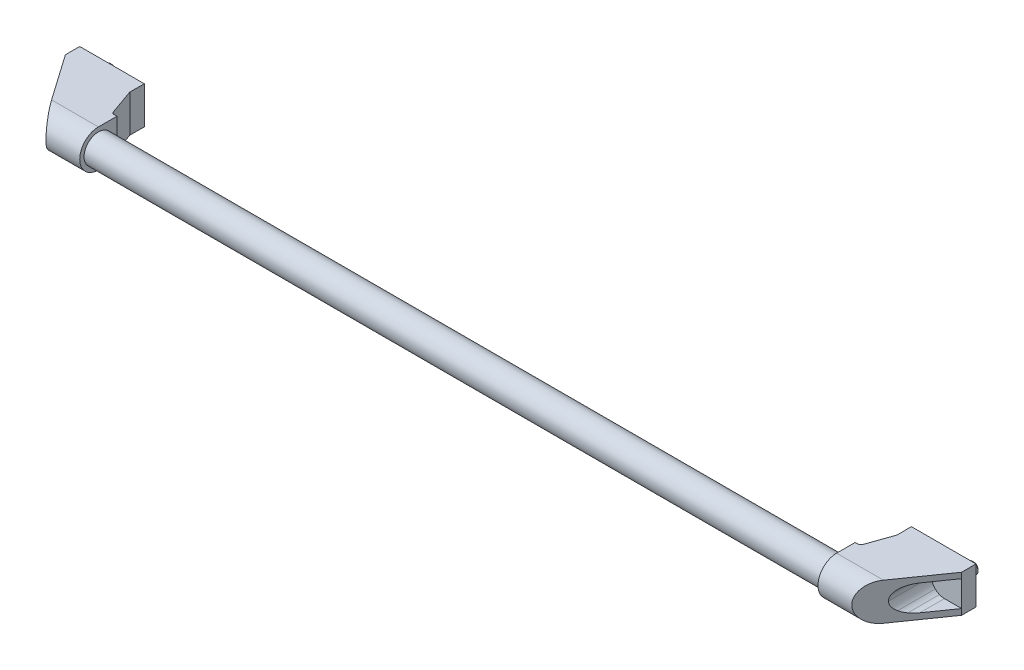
ISO-10303-21;
HEADER;
FILE_DESCRIPTION(('STEP AP214'),'2;1');
FILE_NAME('part.step','',(''),(''),'','','');
FILE_SCHEMA(('AUTOMOTIVE_DESIGN { 1 0 10303 214 1 1 1 1 }'));
ENDSEC;
DATA;
#1=APPLICATION_CONTEXT('core data for automotive mechanical design processes');
#2=APPLICATION_PROTOCOL_DEFINITION('international standard','automotive_design',2000,#1);
#3=PRODUCT_CONTEXT('',#1,'mechanical');
#4=PRODUCT('Part','Part','',(#3));
#5=PRODUCT_RELATED_PRODUCT_CATEGORY('part','',(#4));
#6=PRODUCT_DEFINITION_FORMATION('','',#4);
#7=PRODUCT_DEFINITION_CONTEXT('part definition',#1,'design');
#8=PRODUCT_DEFINITION('design','',#6,#7);
#9=PRODUCT_DEFINITION_SHAPE('','',#8);
#10=(LENGTH_UNIT() NAMED_UNIT(*) SI_UNIT(.MILLI.,.METRE.));
#11=(NAMED_UNIT(*) PLANE_ANGLE_UNIT() SI_UNIT($,.RADIAN.));
#12=(NAMED_UNIT(*) SI_UNIT($,.STERADIAN.) SOLID_ANGLE_UNIT());
#13=UNCERTAINTY_MEASURE_WITH_UNIT(LENGTH_MEASURE(1.E-05),#10,'distance_accuracy_value','');
#14=(GEOMETRIC_REPRESENTATION_CONTEXT(3) GLOBAL_UNCERTAINTY_ASSIGNED_CONTEXT((#13)) GLOBAL_UNIT_ASSIGNED_CONTEXT((#10,
#11,#12)) REPRESENTATION_CONTEXT('',''));
#15=CARTESIAN_POINT('',(0.,0.,0.));
#16=DIRECTION('',(0.,0.,1.));
#17=DIRECTION('',(1.,0.,0.));
#18=AXIS2_PLACEMENT_3D('',#15,#16,#17);
#19=CARTESIAN_POINT('',(-12.,13.,0.));
#20=DIRECTION('',(0.,0.,-1.));
#21=DIRECTION('',(1.,0.,0.));
#22=AXIS2_PLACEMENT_3D('',#19,#20,#21);
#23=PLANE('',#22);
#24=DIRECTION('',(0.,-1.,0.));
#25=VECTOR('',#24,1.);
#26=CARTESIAN_POINT('',(13.,8.,0.));
#27=LINE('',#26,#25);
#28=CARTESIAN_POINT('',(13.,8.,0.));
#29=VERTEX_POINT('',#28);
#30=CARTESIAN_POINT('',(13.,-8.,0.));
#31=VERTEX_POINT('',#30);
#32=EDGE_CURVE('E317',#29,#31,#27,.T.);
#33=ORIENTED_EDGE('',*,*,#32,.T.);
#34=DIRECTION('',(-1.,0.,0.));
#35=VECTOR('',#34,1.);
#36=CARTESIAN_POINT('',(28.,-8.,0.));
#37=LINE('',#36,#35);
#38=CARTESIAN_POINT('',(28.,-8.,0.));
#39=VERTEX_POINT('',#38);
#40=EDGE_CURVE('E304',#39,#31,#37,.T.);
#41=ORIENTED_EDGE('',*,*,#40,.F.);
#42=DIRECTION('',(0.,1.,0.));
#43=VECTOR('',#42,1.);
#44=CARTESIAN_POINT('',(28.,-8.,0.));
#45=LINE('',#44,#43);
#46=CARTESIAN_POINT('',(28.,8.,0.));
#47=VERTEX_POINT('',#46);
#48=EDGE_CURVE('E287',#39,#47,#45,.T.);
#49=ORIENTED_EDGE('',*,*,#48,.T.);
#50=DIRECTION('',(1.,0.,0.));
#51=VECTOR('',#50,1.);
#52=CARTESIAN_POINT('',(13.,8.,0.));
#53=LINE('',#52,#51);
#54=EDGE_CURVE('E301',#29,#47,#53,.T.);
#55=ORIENTED_EDGE('',*,*,#54,.F.);
#56=EDGE_LOOP('',(#33,#41,#49,#55));
#57=FACE_BOUND('',#56,.T.);
#58=DIRECTION('',(0.,1.,0.));
#59=VECTOR('',#58,1.);
#60=CARTESIAN_POINT('',(33.,-13.,0.));
#61=LINE('',#60,#59);
#62=CARTESIAN_POINT('',(33.,-13.,0.));
#63=VERTEX_POINT('',#62);
#64=CARTESIAN_POINT('',(33.,13.,0.));
#65=VERTEX_POINT('',#64);
#66=EDGE_CURVE('E410',#63,#65,#61,.T.);
#67=ORIENTED_EDGE('',*,*,#66,.F.);
#68=DIRECTION('',(1.,0.,0.));
#69=VECTOR('',#68,1.);
#70=CARTESIAN_POINT('',(-12.,-13.,0.));
#71=LINE('',#70,#69);
#72=CARTESIAN_POINT('',(-12.,-13.,0.));
#73=VERTEX_POINT('',#72);
#74=EDGE_CURVE('E444',#73,#63,#71,.T.);
#75=ORIENTED_EDGE('',*,*,#74,.F.);
#76=DIRECTION('',(0.,-1.,0.));
#77=VECTOR('',#76,1.);
#78=CARTESIAN_POINT('',(-12.,13.,0.));
#79=LINE('',#78,#77);
#80=CARTESIAN_POINT('',(-12.,13.,0.));
#81=VERTEX_POINT('',#80);
#82=EDGE_CURVE('E436',#81,#73,#79,.T.);
#83=ORIENTED_EDGE('',*,*,#82,.F.);
#84=DIRECTION('',(1.,0.,0.));
#85=VECTOR('',#84,1.);
#86=CARTESIAN_POINT('',(-12.,13.,0.));
#87=LINE('',#86,#85);
#88=EDGE_CURVE('E441',#81,#65,#87,.T.);
#89=ORIENTED_EDGE('',*,*,#88,.T.);
#90=EDGE_LOOP('',(#67,#75,#83,#89));
#91=FACE_BOUND('',#90,.T.);
#92=CARTESIAN_POINT('',(0.,0.,0.));
#93=DIRECTION('',(0.,0.,-1.));
#94=DIRECTION('',(-1.,0.,0.));
#95=AXIS2_PLACEMENT_3D('',#92,#93,#94);
#96=CIRCLE('',#95,4.);
#97=CARTESIAN_POINT('',(-4.,0.,0.));
#98=VERTEX_POINT('',#97);
#99=EDGE_CURVE('E1268',#98,#98,#96,.T.);
#100=ORIENTED_EDGE('',*,*,#99,.F.);
#101=EDGE_LOOP('',(#100));
#102=FACE_BOUND('',#101,.T.);
#103=ADVANCED_FACE('F14',(#57,#91,#102),#23,.T.);
#104=CARTESIAN_POINT('',(-11.9999999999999,-13.,10.));
#105=DIRECTION('',(0.819152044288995,0.,-0.573576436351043));
#106=DIRECTION('',(0.573576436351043,0.,0.819152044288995));
#107=AXIS2_PLACEMENT_3D('',#104,#105,#106);
#108=PLANE('',#107);
#109=DIRECTION('',(-0.573576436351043,0.,-0.819152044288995));
#110=VECTOR('',#109,1.);
#111=CARTESIAN_POINT('',(-11.9999999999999,-8.90119415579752,10.));
#112=LINE('',#111,#110);
#113=CARTESIAN_POINT('',(7.15225699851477E-06,-8.90119415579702,27.1377862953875));
#114=VERTEX_POINT('',#113);
#115=CARTESIAN_POINT('',(-11.9999999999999,-8.90119415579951,10.));
#116=VERTEX_POINT('',#115);
#117=EDGE_CURVE('E472',#114,#116,#112,.T.);
#118=ORIENTED_EDGE('',*,*,#117,.T.);
#119=DIRECTION('',(0.,1.,0.));
#120=VECTOR('',#119,1.);
#121=CARTESIAN_POINT('',(-11.9999999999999,-13.,10.));
#122=LINE('',#121,#120);
#123=CARTESIAN_POINT('',(-11.9999999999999,-13.,10.));
#124=VERTEX_POINT('',#123);
#125=EDGE_CURVE('E420',#124,#116,#122,.T.);
#126=ORIENTED_EDGE('',*,*,#125,.F.);
#127=DIRECTION('',(0.573576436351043,0.,0.819152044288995));
#128=VECTOR('',#127,1.);
#129=CARTESIAN_POINT('',(-11.9999999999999,-13.,10.));
#130=LINE('',#129,#128);
#131=CARTESIAN_POINT('',(10.40664122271,-13.,42.));
#132=VERTEX_POINT('',#131);
#133=EDGE_CURVE('E416',#124,#132,#130,.T.);
#134=ORIENTED_EDGE('',*,*,#133,.T.);
#135=CARTESIAN_POINT('',(10.40664122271,0.,42.));
#136=DIRECTION('',(-0.819152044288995,0.,0.573576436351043));
#137=DIRECTION('',(0.573576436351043,0.,0.819152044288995));
#138=AXIS2_PLACEMENT_3D('',#135,#136,#137);
#139=ELLIPSE('',#138,15.8700696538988,13.);
#140=CARTESIAN_POINT('',(10.40664122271,13.,42.));
#141=VERTEX_POINT('',#140);
#142=EDGE_CURVE('E423',#132,#141,#139,.T.);
#143=ORIENTED_EDGE('',*,*,#142,.T.);
#144=DIRECTION('',(0.573576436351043,0.,0.819152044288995));
#145=VECTOR('',#144,1.);
#146=CARTESIAN_POINT('',(-11.9999999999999,13.,10.));
#147=LINE('',#146,#145);
#148=CARTESIAN_POINT('',(-11.9999999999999,13.,10.));
#149=VERTEX_POINT('',#148);
#150=EDGE_CURVE('E413',#149,#141,#147,.T.);
#151=ORIENTED_EDGE('',*,*,#150,.F.);
#152=CARTESIAN_POINT('',(-11.9999999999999,9.09880893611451,10.));
#153=VERTEX_POINT('',#152);
#154=EDGE_CURVE('E419',#153,#149,#122,.T.);
#155=ORIENTED_EDGE('',*,*,#154,.F.);
#156=DIRECTION('',(-0.573576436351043,0.,-0.819152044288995));
#157=VECTOR('',#156,1.);
#158=CARTESIAN_POINT('',(-11.9999999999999,9.09880893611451,10.));
#159=LINE('',#158,#157);
#160=CARTESIAN_POINT('',(0.,9.09880893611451,27.1377760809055));
#161=VERTEX_POINT('',#160);
#162=EDGE_CURVE('E451',#161,#153,#159,.T.);
#163=ORIENTED_EDGE('',*,*,#162,.F.);
#164=CARTESIAN_POINT('',(-6.6150140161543E-06,0.098772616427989,27.1377666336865));
#165=DIRECTION('',(-0.819152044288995,0.,0.573576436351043));
#166=DIRECTION('',(0.573576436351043,0.,0.819152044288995));
#167=AXIS2_PLACEMENT_3D('',#164,#165,#166);
#168=ELLIPSE('',#167,15.691084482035,9.0000363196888);
#169=CARTESIAN_POINT('',(3.444151,8.4137249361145,32.056533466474));
#170=VERTEX_POINT('',#169);
#171=EDGE_CURVE('E454',#170,#161,#168,.T.);
#172=ORIENTED_EDGE('',*,*,#171,.F.);
#173=CARTESIAN_POINT('',(-2.10368269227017E-05,0.0987787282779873,27.137746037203));
#174=DIRECTION('',(-0.819152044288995,0.,0.573576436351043));
#175=DIRECTION('',(0.573576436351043,0.,0.819152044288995));
#176=AXIS2_PLACEMENT_3D('',#173,#174,#175);
#177=ELLIPSE('',#176,15.6910842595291,9.00003619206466);
#178=CARTESIAN_POINT('',(6.363961,6.4627699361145,36.22645429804));
#179=VERTEX_POINT('',#178);
#180=EDGE_CURVE('E457',#179,#170,#177,.T.);
#181=ORIENTED_EDGE('',*,*,#180,.F.);
#182=CARTESIAN_POINT('',(-3.07078370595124E-05,0.098790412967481,27.13773222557));
#183=DIRECTION('',(-0.819152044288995,0.,0.573576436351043));
#184=DIRECTION('',(0.573576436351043,0.,0.819152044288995));
#185=AXIS2_PLACEMENT_3D('',#182,#183,#184);
#186=ELLIPSE('',#185,15.6910817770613,9.00003476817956);
#187=CARTESIAN_POINT('',(9.00000406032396,0.0988089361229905,39.9911139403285));
#188=VERTEX_POINT('',#187);
#189=EDGE_CURVE('E460',#188,#179,#186,.T.);
#190=ORIENTED_EDGE('',*,*,#189,.F.);
#191=CARTESIAN_POINT('',(-3.27593619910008E-05,0.0988180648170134,27.1377292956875));
#192=DIRECTION('',(-0.819152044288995,0.,0.573576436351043));
#193=DIRECTION('',(0.573576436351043,0.,0.819152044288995));
#194=AXIS2_PLACEMENT_3D('',#191,#192,#193);
#195=ELLIPSE('',#194,15.6910853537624,9.00003681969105);
#196=CARTESIAN_POINT('',(6.36396815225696,-6.26515515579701,36.2264645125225));
#197=VERTEX_POINT('',#196);
#198=EDGE_CURVE('E463',#197,#188,#195,.T.);
#199=ORIENTED_EDGE('',*,*,#198,.F.);
#200=CARTESIAN_POINT('',(-1.38845689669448E-05,0.0988360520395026,27.137756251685));
#201=DIRECTION('',(-0.819152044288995,0.,0.573576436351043));
#202=DIRECTION('',(0.573576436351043,0.,0.819152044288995));
#203=AXIS2_PLACEMENT_3D('',#200,#201,#202);
#204=ELLIPSE('',#203,15.6910842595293,9.00003619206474);
#205=CARTESIAN_POINT('',(3.44415815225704,-8.21611015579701,32.0565436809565));
#206=VERTEX_POINT('',#205);
#207=EDGE_CURVE('E466',#206,#197,#204,.T.);
#208=ORIENTED_EDGE('',*,*,#207,.F.);
#209=CARTESIAN_POINT('',(5.37242939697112E-07,0.0988421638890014,27.1377768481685));
#210=DIRECTION('',(-0.819152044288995,0.,0.573576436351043));
#211=DIRECTION('',(0.573576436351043,0.,0.819152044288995));
#212=AXIS2_PLACEMENT_3D('',#209,#210,#211);
#213=ELLIPSE('',#212,15.6910844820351,9.00003631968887);
#214=EDGE_CURVE('E469',#114,#206,#213,.T.);
#215=ORIENTED_EDGE('',*,*,#214,.F.);
#216=EDGE_LOOP('',(#118,#126,#134,#143,#151,#155,#163,#172,#181,#190,#199,#208,#215));
#217=FACE_BOUND('',#216,.T.);
#218=ADVANCED_FACE('F725',(#217),#108,.F.);
#219=CARTESIAN_POINT('',(-12.,13.,42.));
#220=DIRECTION('',(0.,1.,0.));
#221=DIRECTION('',(1.,0.,0.));
#222=AXIS2_PLACEMENT_3D('',#219,#220,#221);
#223=PLANE('',#222);
#224=DIRECTION('',(0.0104830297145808,0.,-0.999945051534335));
#225=VECTOR('',#224,1.);
#226=CARTESIAN_POINT('',(32.8951697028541,13.,9.99945051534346));
#227=LINE('',#226,#225);
#228=CARTESIAN_POINT('',(32.8951697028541,13.,9.99945051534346));
#229=VERTEX_POINT('',#228);
#230=EDGE_CURVE('E388',#229,#65,#227,.T.);
#231=ORIENTED_EDGE('',*,*,#230,.T.);
#232=ORIENTED_EDGE('',*,*,#88,.F.);
#233=DIRECTION('',(0.,0.,-1.));
#234=VECTOR('',#233,1.);
#235=CARTESIAN_POINT('',(-12.,13.,42.));
#236=LINE('',#235,#234);
#237=EDGE_CURVE('E434',#149,#81,#236,.T.);
#238=ORIENTED_EDGE('',*,*,#237,.F.);
#239=ORIENTED_EDGE('',*,*,#150,.T.);
#240=DIRECTION('',(1.,0.,0.));
#241=VECTOR('',#240,1.);
#242=CARTESIAN_POINT('',(-12.,13.,42.));
#243=LINE('',#242,#241);
#244=CARTESIAN_POINT('',(43.,13.,42.));
#245=VERTEX_POINT('',#244);
#246=EDGE_CURVE('E449',#141,#245,#243,.T.);
#247=ORIENTED_EDGE('',*,*,#246,.T.);
#248=DIRECTION('',(0.,0.,-1.));
#249=VECTOR('',#248,1.);
#250=CARTESIAN_POINT('',(43.,13.,42.));
#251=LINE('',#250,#249);
#252=CARTESIAN_POINT('',(43.,13.,29.106429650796));
#253=VERTEX_POINT('',#252);
#254=EDGE_CURVE('E425',#245,#253,#251,.T.);
#255=ORIENTED_EDGE('',*,*,#254,.T.);
#256=DIRECTION('',(-0.999945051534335,0.,-0.0104830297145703));
#257=VECTOR('',#256,1.);
#258=CARTESIAN_POINT('',(43.,13.,29.106429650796));
#259=LINE('',#258,#257);
#260=CARTESIAN_POINT('',(41.0113841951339,13.,29.0855817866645));
#261=VERTEX_POINT('',#260);
#262=EDGE_CURVE('E379',#253,#261,#259,.T.);
#263=ORIENTED_EDGE('',*,*,#262,.T.);
#264=CARTESIAN_POINT('',(41.0323502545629,13.,27.085691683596));
#265=DIRECTION('',(0.,-1.,0.));
#266=DIRECTION('',(1.,0.,0.));
#267=AXIS2_PLACEMENT_3D('',#264,#265,#266);
#268=CIRCLE('',#267,2.);
#269=CARTESIAN_POINT('',(39.145897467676,13.,27.7499927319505));
#270=VERTEX_POINT('',#269);
#271=EDGE_CURVE('E382',#261,#270,#268,.T.);
#272=ORIENTED_EDGE('',*,*,#271,.T.);
#273=DIRECTION('',(0.332150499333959,0.,0.943226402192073));
#274=VECTOR('',#273,1.);
#275=CARTESIAN_POINT('',(32.8951697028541,13.,9.99945051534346));
#276=LINE('',#275,#274);
#277=EDGE_CURVE('E385',#229,#270,#276,.T.);
#278=ORIENTED_EDGE('',*,*,#277,.F.);
#279=EDGE_LOOP('',(#231,#232,#238,#239,#247,#255,#263,#272,#278));
#280=FACE_BOUND('',#279,.T.);
#281=ADVANCED_FACE('F731',(#280),#223,.T.);
#282=CARTESIAN_POINT('',(-12.,0.,42.));
#283=DIRECTION('',(1.,0.,0.));
#284=DIRECTION('',(0.,-1.,0.));
#285=AXIS2_PLACEMENT_3D('',#282,#283,#284);
#286=CYLINDRICAL_SURFACE('',#285,13.);
#287=ORIENTED_EDGE('',*,*,#142,.F.);
#288=DIRECTION('',(1.,0.,0.));
#289=VECTOR('',#288,1.);
#290=CARTESIAN_POINT('',(-12.,-13.,42.));
#291=LINE('',#290,#289);
#292=CARTESIAN_POINT('',(43.,-13.,42.));
#293=VERTEX_POINT('',#292);
#294=EDGE_CURVE('E447',#132,#293,#291,.T.);
#295=ORIENTED_EDGE('',*,*,#294,.T.);
#296=CARTESIAN_POINT('',(43.,0.,42.));
#297=DIRECTION('',(1.,0.,0.));
#298=DIRECTION('',(0.,1.,0.));
#299=AXIS2_PLACEMENT_3D('',#296,#297,#298);
#300=CIRCLE('',#299,13.);
#301=EDGE_CURVE('E431',#245,#293,#300,.T.);
#302=ORIENTED_EDGE('',*,*,#301,.F.);
#303=ORIENTED_EDGE('',*,*,#246,.F.);
#304=EDGE_LOOP('',(#287,#295,#302,#303));
#305=FACE_BOUND('',#304,.T.);
#306=ADVANCED_FACE('F741',(#305),#286,.T.);
#307=CARTESIAN_POINT('',(-12.,-13.,42.));
#308=DIRECTION('',(0.,1.,0.));
#309=DIRECTION('',(1.,0.,0.));
#310=AXIS2_PLACEMENT_3D('',#307,#308,#309);
#311=PLANE('',#310);
#312=DIRECTION('',(0.332150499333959,0.,0.943226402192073));
#313=VECTOR('',#312,1.);
#314=CARTESIAN_POINT('',(32.8951697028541,-13.,9.99945051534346));
#315=LINE('',#314,#313);
#316=CARTESIAN_POINT('',(32.8951697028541,-13.,9.99945051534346));
#317=VERTEX_POINT('',#316);
#318=CARTESIAN_POINT('',(39.145897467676,-13.,27.7499927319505));
#319=VERTEX_POINT('',#318);
#320=EDGE_CURVE('E396',#317,#319,#315,.T.);
#321=ORIENTED_EDGE('',*,*,#320,.T.);
#322=CARTESIAN_POINT('',(41.0323502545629,-13.,27.085691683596));
#323=DIRECTION('',(0.,-1.,0.));
#324=DIRECTION('',(1.,0.,0.));
#325=AXIS2_PLACEMENT_3D('',#322,#323,#324);
#326=CIRCLE('',#325,2.);
#327=CARTESIAN_POINT('',(41.0113841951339,-13.,29.0855817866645));
#328=VERTEX_POINT('',#327);
#329=EDGE_CURVE('E393',#328,#319,#326,.T.);
#330=ORIENTED_EDGE('',*,*,#329,.F.);
#331=DIRECTION('',(-0.999945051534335,0.,-0.0104830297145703));
#332=VECTOR('',#331,1.);
#333=CARTESIAN_POINT('',(43.,-13.,29.106429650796));
#334=LINE('',#333,#332);
#335=CARTESIAN_POINT('',(43.,-13.,29.106429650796));
#336=VERTEX_POINT('',#335);
#337=EDGE_CURVE('E390',#336,#328,#334,.T.);
#338=ORIENTED_EDGE('',*,*,#337,.F.);
#339=DIRECTION('',(0.,0.,-1.));
#340=VECTOR('',#339,1.);
#341=CARTESIAN_POINT('',(43.,-13.,42.));
#342=LINE('',#341,#340);
#343=EDGE_CURVE('E428',#293,#336,#342,.T.);
#344=ORIENTED_EDGE('',*,*,#343,.F.);
#345=ORIENTED_EDGE('',*,*,#294,.F.);
#346=ORIENTED_EDGE('',*,*,#133,.F.);
#347=DIRECTION('',(0.,0.,-1.));
#348=VECTOR('',#347,1.);
#349=CARTESIAN_POINT('',(-12.,-13.,42.));
#350=LINE('',#349,#348);
#351=EDGE_CURVE('E439',#124,#73,#350,.T.);
#352=ORIENTED_EDGE('',*,*,#351,.T.);
#353=ORIENTED_EDGE('',*,*,#74,.T.);
#354=DIRECTION('',(0.0104830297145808,0.,-0.999945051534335));
#355=VECTOR('',#354,1.);
#356=CARTESIAN_POINT('',(32.8951697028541,-13.,9.99945051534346));
#357=LINE('',#356,#355);
#358=EDGE_CURVE('E399',#317,#63,#357,.T.);
#359=ORIENTED_EDGE('',*,*,#358,.F.);
#360=EDGE_LOOP('',(#321,#330,#338,#344,#345,#346,#352,#353,#359));
#361=FACE_BOUND('',#360,.T.);
#362=ADVANCED_FACE('F737',(#361),#311,.F.);
#363=CARTESIAN_POINT('',(-12.,0.,42.));
#364=DIRECTION('',(-1.,0.,0.));
#365=DIRECTION('',(0.,1.,0.));
#366=AXIS2_PLACEMENT_3D('',#363,#364,#365);
#367=PLANE('',#366);
#368=ORIENTED_EDGE('',*,*,#125,.T.);
#369=DIRECTION('',(0.,1.,0.));
#370=VECTOR('',#369,1.);
#371=CARTESIAN_POINT('',(-11.9999999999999,-8.90119415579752,10.));
#372=LINE('',#371,#370);
#373=EDGE_CURVE('E355',#116,#153,#372,.T.);
#374=ORIENTED_EDGE('',*,*,#373,.T.);
#375=ORIENTED_EDGE('',*,*,#154,.T.);
#376=ORIENTED_EDGE('',*,*,#237,.T.);
#377=ORIENTED_EDGE('',*,*,#82,.T.);
#378=ORIENTED_EDGE('',*,*,#351,.F.);
#379=EDGE_LOOP('',(#368,#374,#375,#376,#377,#378));
#380=FACE_BOUND('',#379,.T.);
#381=ADVANCED_FACE('F740',(#380),#367,.T.);
#382=CARTESIAN_POINT('',(43.,0.,42.));
#383=DIRECTION('',(-1.,0.,0.));
#384=DIRECTION('',(0.,1.,0.));
#385=AXIS2_PLACEMENT_3D('',#382,#383,#384);
#386=PLANE('',#385);
#387=ORIENTED_EDGE('',*,*,#254,.F.);
#388=ORIENTED_EDGE('',*,*,#301,.T.);
#389=ORIENTED_EDGE('',*,*,#343,.T.);
#390=DIRECTION('',(0.,1.,0.));
#391=VECTOR('',#390,1.);
#392=CARTESIAN_POINT('',(43.,-13.,29.106429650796));
#393=LINE('',#392,#391);
#394=EDGE_CURVE('E402',#336,#253,#393,.T.);
#395=ORIENTED_EDGE('',*,*,#394,.T.);
#396=EDGE_LOOP('',(#387,#388,#389,#395));
#397=FACE_BOUND('',#396,.T.);
#398=CARTESIAN_POINT('',(43.,0.,42.));
#399=DIRECTION('',(-1.,0.,0.));
#400=DIRECTION('',(0.,0.,1.));
#401=AXIS2_PLACEMENT_3D('',#398,#399,#400);
#402=CIRCLE('',#401,10.);
#403=CARTESIAN_POINT('',(43.,0.,52.));
#404=VERTEX_POINT('',#403);
#405=EDGE_CURVE('E1264',#404,#404,#402,.T.);
#406=ORIENTED_EDGE('',*,*,#405,.T.);
#407=EDGE_LOOP('',(#406));
#408=FACE_BOUND('',#407,.T.);
#409=ADVANCED_FACE('F1207',(#397,#408),#386,.F.);
#410=CARTESIAN_POINT('',(32.8951697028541,-13.,9.99945051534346));
#411=DIRECTION('',(-0.999945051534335,0.,-0.0104830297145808));
#412=DIRECTION('',(0.0104830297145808,0.,-0.999945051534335));
#413=AXIS2_PLACEMENT_3D('',#410,#411,#412);
#414=PLANE('',#413);
#415=DIRECTION('',(0.,1.,0.));
#416=VECTOR('',#415,1.);
#417=CARTESIAN_POINT('',(32.8951697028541,-13.,9.99945051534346));
#418=LINE('',#417,#416);
#419=EDGE_CURVE('E408',#317,#229,#418,.T.);
#420=ORIENTED_EDGE('',*,*,#419,.F.);
#421=ORIENTED_EDGE('',*,*,#358,.T.);
#422=ORIENTED_EDGE('',*,*,#66,.T.);
#423=ORIENTED_EDGE('',*,*,#230,.F.);
#424=EDGE_LOOP('',(#420,#421,#422,#423));
#425=FACE_BOUND('',#424,.T.);
#426=ADVANCED_FACE('F1198',(#425),#414,.F.);
#427=CARTESIAN_POINT('',(32.8951697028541,-13.,9.99945051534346));
#428=DIRECTION('',(0.943226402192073,0.,-0.332150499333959));
#429=DIRECTION('',(0.332150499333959,0.,0.943226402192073));
#430=AXIS2_PLACEMENT_3D('',#427,#428,#429);
#431=PLANE('',#430);
#432=DIRECTION('',(0.,1.,0.));
#433=VECTOR('',#432,1.);
#434=CARTESIAN_POINT('',(39.145897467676,-13.,27.7499927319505));
#435=LINE('',#434,#433);
#436=EDGE_CURVE('E406',#319,#270,#435,.T.);
#437=ORIENTED_EDGE('',*,*,#436,.F.);
#438=ORIENTED_EDGE('',*,*,#320,.F.);
#439=ORIENTED_EDGE('',*,*,#419,.T.);
#440=ORIENTED_EDGE('',*,*,#277,.T.);
#441=EDGE_LOOP('',(#437,#438,#439,#440));
#442=FACE_BOUND('',#441,.T.);
#443=ADVANCED_FACE('F1189',(#442),#431,.T.);
#444=CARTESIAN_POINT('',(41.0323502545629,-13.,27.085691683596));
#445=DIRECTION('',(0.,1.,0.));
#446=DIRECTION('',(1.,0.,0.));
#447=AXIS2_PLACEMENT_3D('',#444,#445,#446);
#448=CYLINDRICAL_SURFACE('',#447,2.);
#449=DIRECTION('',(0.,1.,0.));
#450=VECTOR('',#449,1.);
#451=CARTESIAN_POINT('',(41.0113841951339,-13.,29.0855817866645));
#452=LINE('',#451,#450);
#453=EDGE_CURVE('E404',#328,#261,#452,.T.);
#454=ORIENTED_EDGE('',*,*,#453,.F.);
#455=ORIENTED_EDGE('',*,*,#329,.T.);
#456=ORIENTED_EDGE('',*,*,#436,.T.);
#457=ORIENTED_EDGE('',*,*,#271,.F.);
#458=EDGE_LOOP('',(#454,#455,#456,#457));
#459=FACE_BOUND('',#458,.T.);
#460=ADVANCED_FACE('F1180',(#459),#448,.F.);
#461=CARTESIAN_POINT('',(43.,-13.,29.106429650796));
#462=DIRECTION('',(-0.0104830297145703,0.,0.999945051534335));
#463=DIRECTION('',(-0.999945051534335,0.,-0.0104830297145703));
#464=AXIS2_PLACEMENT_3D('',#461,#462,#463);
#465=PLANE('',#464);
#466=ORIENTED_EDGE('',*,*,#394,.F.);
#467=ORIENTED_EDGE('',*,*,#337,.T.);
#468=ORIENTED_EDGE('',*,*,#453,.T.);
#469=ORIENTED_EDGE('',*,*,#262,.F.);
#470=EDGE_LOOP('',(#466,#467,#468,#469));
#471=FACE_BOUND('',#470,.T.);
#472=ADVANCED_FACE('F1171',(#471),#465,.F.);
#473=CARTESIAN_POINT('',(-11.9999999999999,-8.90119415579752,10.));
#474=DIRECTION('',(0.,1.,0.));
#475=DIRECTION('',(1.,0.,0.));
#476=AXIS2_PLACEMENT_3D('',#473,#474,#475);
#477=PLANE('',#476);
#478=ORIENTED_EDGE('',*,*,#117,.F.);
#479=DIRECTION('',(0.,0.,1.));
#480=VECTOR('',#479,1.);
#481=CARTESIAN_POINT('',(7.15225700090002E-06,-8.90119415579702,10.));
#482=LINE('',#481,#480);
#483=CARTESIAN_POINT('',(7.15225700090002E-06,-8.90119415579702,10.));
#484=VERTEX_POINT('',#483);
#485=EDGE_CURVE('E376',#484,#114,#482,.T.);
#486=ORIENTED_EDGE('',*,*,#485,.F.);
#487=DIRECTION('',(1.,0.,0.));
#488=VECTOR('',#487,1.);
#489=CARTESIAN_POINT('',(-11.9999999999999,-8.90119415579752,10.));
#490=LINE('',#489,#488);
#491=EDGE_CURVE('E294',#116,#484,#490,.T.);
#492=ORIENTED_EDGE('',*,*,#491,.F.);
#493=EDGE_LOOP('',(#478,#486,#492));
#494=FACE_BOUND('',#493,.T.);
#495=ADVANCED_FACE('F1162',(#494),#477,.T.);
#496=CARTESIAN_POINT('',(5.37243022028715E-07,0.0988421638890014,10.));
#497=DIRECTION('',(0.,0.,1.));
#498=DIRECTION('',(-1.,0.,0.));
#499=AXIS2_PLACEMENT_3D('',#496,#497,#498);
#500=CYLINDRICAL_SURFACE('',#499,9.00003631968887);
#501=ORIENTED_EDGE('',*,*,#485,.T.);
#502=ORIENTED_EDGE('',*,*,#214,.T.);
#503=DIRECTION('',(0.,0.,1.));
#504=VECTOR('',#503,1.);
#505=CARTESIAN_POINT('',(3.44415815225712,-8.21611015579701,10.));
#506=LINE('',#505,#504);
#507=CARTESIAN_POINT('',(3.44415815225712,-8.21611015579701,10.));
#508=VERTEX_POINT('',#507);
#509=EDGE_CURVE('E373',#508,#206,#506,.T.);
#510=ORIENTED_EDGE('',*,*,#509,.F.);
#511=CARTESIAN_POINT('',(5.37243022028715E-07,0.0988421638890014,10.));
#512=DIRECTION('',(0.,0.,-1.));
#513=DIRECTION('',(-1.,0.,0.));
#514=AXIS2_PLACEMENT_3D('',#511,#512,#513);
#515=CIRCLE('',#514,9.00003631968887);
#516=EDGE_CURVE('E334',#508,#484,#515,.T.);
#517=ORIENTED_EDGE('',*,*,#516,.T.);
#518=EDGE_LOOP('',(#501,#502,#510,#517));
#519=FACE_BOUND('',#518,.T.);
#520=ADVANCED_FACE('F1153',(#519),#500,.F.);
#521=CARTESIAN_POINT('',(-1.38845689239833E-05,0.0988360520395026,10.));
#522=DIRECTION('',(0.,0.,1.));
#523=DIRECTION('',(-1.,0.,0.));
#524=AXIS2_PLACEMENT_3D('',#521,#522,#523);
#525=CYLINDRICAL_SURFACE('',#524,9.00003619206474);
#526=ORIENTED_EDGE('',*,*,#509,.T.);
#527=ORIENTED_EDGE('',*,*,#207,.T.);
#528=DIRECTION('',(0.,0.,1.));
#529=VECTOR('',#528,1.);
#530=CARTESIAN_POINT('',(6.36396815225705,-6.26515515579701,10.));
#531=LINE('',#530,#529);
#532=CARTESIAN_POINT('',(6.36396815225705,-6.26515515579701,10.));
#533=VERTEX_POINT('',#532);
#534=EDGE_CURVE('E370',#533,#197,#531,.T.);
#535=ORIENTED_EDGE('',*,*,#534,.F.);
#536=CARTESIAN_POINT('',(-1.38845689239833E-05,0.0988360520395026,10.));
#537=DIRECTION('',(0.,0.,-1.));
#538=DIRECTION('',(-1.,0.,0.));
#539=AXIS2_PLACEMENT_3D('',#536,#537,#538);
#540=CIRCLE('',#539,9.00003619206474);
#541=EDGE_CURVE('E337',#533,#508,#540,.T.);
#542=ORIENTED_EDGE('',*,*,#541,.T.);
#543=EDGE_LOOP('',(#526,#527,#535,#542));
#544=FACE_BOUND('',#543,.T.);
#545=ADVANCED_FACE('F1144',(#544),#525,.F.);
#546=CARTESIAN_POINT('',(-3.27593619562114E-05,0.0988180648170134,10.));
#547=DIRECTION('',(0.,0.,1.));
#548=DIRECTION('',(-1.,0.,0.));
#549=AXIS2_PLACEMENT_3D('',#546,#547,#548);
#550=CYLINDRICAL_SURFACE('',#549,9.00003681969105);
#551=ORIENTED_EDGE('',*,*,#534,.T.);
#552=ORIENTED_EDGE('',*,*,#198,.T.);
#553=DIRECTION('',(0.,0.,1.));
#554=VECTOR('',#553,1.);
#555=CARTESIAN_POINT('',(9.00000406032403,0.0988089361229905,10.));
#556=LINE('',#555,#554);
#557=CARTESIAN_POINT('',(9.00000406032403,0.0988089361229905,10.));
#558=VERTEX_POINT('',#557);
#559=EDGE_CURVE('E367',#558,#188,#556,.T.);
#560=ORIENTED_EDGE('',*,*,#559,.F.);
#561=CARTESIAN_POINT('',(-3.27593619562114E-05,0.0988180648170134,10.));
#562=DIRECTION('',(0.,0.,-1.));
#563=DIRECTION('',(-1.,0.,0.));
#564=AXIS2_PLACEMENT_3D('',#561,#562,#563);
#565=CIRCLE('',#564,9.00003681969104);
#566=EDGE_CURVE('E340',#558,#533,#565,.T.);
#567=ORIENTED_EDGE('',*,*,#566,.T.);
#568=EDGE_LOOP('',(#551,#552,#560,#567));
#569=FACE_BOUND('',#568,.T.);
#570=ADVANCED_FACE('F1135',(#569),#550,.F.);
#571=CARTESIAN_POINT('',(-3.07078369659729E-05,0.098790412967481,10.));
#572=DIRECTION('',(0.,0.,1.));
#573=DIRECTION('',(-1.,0.,0.));
#574=AXIS2_PLACEMENT_3D('',#571,#572,#573);
#575=CYLINDRICAL_SURFACE('',#574,9.00003476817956);
#576=ORIENTED_EDGE('',*,*,#559,.T.);
#577=ORIENTED_EDGE('',*,*,#189,.T.);
#578=DIRECTION('',(0.,0.,1.));
#579=VECTOR('',#578,1.);
#580=CARTESIAN_POINT('',(6.363961,6.4627699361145,10.));
#581=LINE('',#580,#579);
#582=CARTESIAN_POINT('',(6.363961,6.4627699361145,10.));
#583=VERTEX_POINT('',#582);
#584=EDGE_CURVE('E364',#583,#179,#581,.T.);
#585=ORIENTED_EDGE('',*,*,#584,.F.);
#586=CARTESIAN_POINT('',(-3.07078369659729E-05,0.098790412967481,10.));
#587=DIRECTION('',(0.,0.,-1.));
#588=DIRECTION('',(-1.,0.,0.));
#589=AXIS2_PLACEMENT_3D('',#586,#587,#588);
#590=CIRCLE('',#589,9.00003476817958);
#591=EDGE_CURVE('E343',#583,#558,#590,.T.);
#592=ORIENTED_EDGE('',*,*,#591,.T.);
#593=EDGE_LOOP('',(#576,#577,#585,#592));
#594=FACE_BOUND('',#593,.T.);
#595=ADVANCED_FACE('F1126',(#594),#575,.F.);
#596=CARTESIAN_POINT('',(-2.10368269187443E-05,0.0987787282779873,10.));
#597=DIRECTION('',(0.,0.,1.));
#598=DIRECTION('',(-1.,0.,0.));
#599=AXIS2_PLACEMENT_3D('',#596,#597,#598);
#600=CYLINDRICAL_SURFACE('',#599,9.00003619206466);
#601=ORIENTED_EDGE('',*,*,#584,.T.);
#602=ORIENTED_EDGE('',*,*,#180,.T.);
#603=DIRECTION('',(0.,0.,1.));
#604=VECTOR('',#603,1.);
#605=CARTESIAN_POINT('',(3.444151,8.4137249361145,10.));
#606=LINE('',#605,#604);
#607=CARTESIAN_POINT('',(3.444151,8.4137249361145,10.));
#608=VERTEX_POINT('',#607);
#609=EDGE_CURVE('E361',#608,#170,#606,.T.);
#610=ORIENTED_EDGE('',*,*,#609,.F.);
#611=CARTESIAN_POINT('',(-2.10368269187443E-05,0.0987787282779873,10.));
#612=DIRECTION('',(0.,0.,-1.));
#613=DIRECTION('',(-1.,0.,0.));
#614=AXIS2_PLACEMENT_3D('',#611,#612,#613);
#615=CIRCLE('',#614,9.00003619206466);
#616=EDGE_CURVE('E346',#608,#583,#615,.T.);
#617=ORIENTED_EDGE('',*,*,#616,.T.);
#618=EDGE_LOOP('',(#601,#602,#610,#617));
#619=FACE_BOUND('',#618,.T.);
#620=ADVANCED_FACE('F1117',(#619),#600,.F.);
#621=CARTESIAN_POINT('',(-6.61501397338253E-06,0.098772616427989,10.));
#622=DIRECTION('',(0.,0.,1.));
#623=DIRECTION('',(-1.,0.,0.));
#624=AXIS2_PLACEMENT_3D('',#621,#622,#623);
#625=CYLINDRICAL_SURFACE('',#624,9.0000363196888);
#626=ORIENTED_EDGE('',*,*,#609,.T.);
#627=ORIENTED_EDGE('',*,*,#171,.T.);
#628=DIRECTION('',(0.,0.,1.));
#629=VECTOR('',#628,1.);
#630=CARTESIAN_POINT('',(0.,9.09880893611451,10.));
#631=LINE('',#630,#629);
#632=CARTESIAN_POINT('',(0.,9.09880893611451,10.));
#633=VERTEX_POINT('',#632);
#634=EDGE_CURVE('E358',#633,#161,#631,.T.);
#635=ORIENTED_EDGE('',*,*,#634,.F.);
#636=CARTESIAN_POINT('',(-6.61501397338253E-06,0.098772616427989,10.));
#637=DIRECTION('',(0.,0.,-1.));
#638=DIRECTION('',(-1.,0.,0.));
#639=AXIS2_PLACEMENT_3D('',#636,#637,#638);
#640=CIRCLE('',#639,9.0000363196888);
#641=EDGE_CURVE('E349',#633,#608,#640,.T.);
#642=ORIENTED_EDGE('',*,*,#641,.T.);
#643=EDGE_LOOP('',(#626,#627,#635,#642));
#644=FACE_BOUND('',#643,.T.);
#645=ADVANCED_FACE('F1108',(#644),#625,.F.);
#646=CARTESIAN_POINT('',(-11.9999999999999,9.09880893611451,10.));
#647=DIRECTION('',(0.,1.,0.));
#648=DIRECTION('',(1.,0.,0.));
#649=AXIS2_PLACEMENT_3D('',#646,#647,#648);
#650=PLANE('',#649);
#651=ORIENTED_EDGE('',*,*,#634,.T.);
#652=ORIENTED_EDGE('',*,*,#162,.T.);
#653=DIRECTION('',(1.,0.,0.));
#654=VECTOR('',#653,1.);
#655=CARTESIAN_POINT('',(-11.9999999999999,9.09880893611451,10.));
#656=LINE('',#655,#654);
#657=EDGE_CURVE('E352',#153,#633,#656,.T.);
#658=ORIENTED_EDGE('',*,*,#657,.T.);
#659=EDGE_LOOP('',(#651,#652,#658));
#660=FACE_BOUND('',#659,.T.);
#661=ADVANCED_FACE('F1099',(#660),#650,.F.);
#662=CARTESIAN_POINT('',(5.37243022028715E-07,0.0988421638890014,10.));
#663=DIRECTION('',(0.,0.,1.));
#664=DIRECTION('',(-1.,0.,0.));
#665=AXIS2_PLACEMENT_3D('',#662,#663,#664);
#666=PLANE('',#665);
#667=ORIENTED_EDGE('',*,*,#491,.T.);
#668=ORIENTED_EDGE('',*,*,#516,.F.);
#669=ORIENTED_EDGE('',*,*,#541,.F.);
#670=ORIENTED_EDGE('',*,*,#566,.F.);
#671=ORIENTED_EDGE('',*,*,#591,.F.);
#672=ORIENTED_EDGE('',*,*,#616,.F.);
#673=ORIENTED_EDGE('',*,*,#641,.F.);
#674=ORIENTED_EDGE('',*,*,#657,.F.);
#675=ORIENTED_EDGE('',*,*,#373,.F.);
#676=EDGE_LOOP('',(#667,#668,#669,#670,#671,#672,#673,#674,#675));
#677=FACE_BOUND('',#676,.T.);
#678=ADVANCED_FACE('F1091',(#677),#666,.T.);
#679=CARTESIAN_POINT('',(13.,8.,30.));
#680=DIRECTION('',(0.,-1.,0.));
#681=DIRECTION('',(-1.,0.,0.));
#682=AXIS2_PLACEMENT_3D('',#679,#680,#681);
#683=PLANE('',#682);
#684=DIRECTION('',(0.,0.,-1.));
#685=VECTOR('',#684,1.);
#686=CARTESIAN_POINT('',(28.,8.,30.));
#687=LINE('',#686,#685);
#688=CARTESIAN_POINT('',(28.,8.,30.));
#689=VERTEX_POINT('',#688);
#690=EDGE_CURVE('E284',#689,#47,#687,.T.);
#691=ORIENTED_EDGE('',*,*,#690,.F.);
#692=DIRECTION('',(1.,0.,0.));
#693=VECTOR('',#692,1.);
#694=CARTESIAN_POINT('',(13.,8.,30.));
#695=LINE('',#694,#693);
#696=CARTESIAN_POINT('',(13.,8.,30.));
#697=VERTEX_POINT('',#696);
#698=EDGE_CURVE('E319',#697,#689,#695,.T.);
#699=ORIENTED_EDGE('',*,*,#698,.F.);
#700=DIRECTION('',(0.,0.,-1.));
#701=VECTOR('',#700,1.);
#702=CARTESIAN_POINT('',(13.,8.,30.));
#703=LINE('',#702,#701);
#704=EDGE_CURVE('E307',#697,#29,#703,.T.);
#705=ORIENTED_EDGE('',*,*,#704,.T.);
#706=ORIENTED_EDGE('',*,*,#54,.T.);
#707=EDGE_LOOP('',(#691,#699,#705,#706));
#708=FACE_BOUND('',#707,.T.);
#709=ADVANCED_FACE('F306',(#708),#683,.T.);
#710=CARTESIAN_POINT('',(28.,-8.,30.));
#711=DIRECTION('',(1.,0.,0.));
#712=DIRECTION('',(0.,-1.,0.));
#713=AXIS2_PLACEMENT_3D('',#710,#711,#712);
#714=PLANE('',#713);
#715=DIRECTION('',(0.,0.,-1.));
#716=VECTOR('',#715,1.);
#717=CARTESIAN_POINT('',(28.,-8.,30.));
#718=LINE('',#717,#716);
#719=CARTESIAN_POINT('',(28.,-8.,30.));
#720=VERTEX_POINT('',#719);
#721=EDGE_CURVE('E295',#720,#39,#718,.T.);
#722=ORIENTED_EDGE('',*,*,#721,.F.);
#723=DIRECTION('',(0.,1.,0.));
#724=VECTOR('',#723,1.);
#725=CARTESIAN_POINT('',(28.,-8.,30.));
#726=LINE('',#725,#724);
#727=EDGE_CURVE('E289',#720,#689,#726,.T.);
#728=ORIENTED_EDGE('',*,*,#727,.T.);
#729=ORIENTED_EDGE('',*,*,#690,.T.);
#730=ORIENTED_EDGE('',*,*,#48,.F.);
#731=EDGE_LOOP('',(#722,#728,#729,#730));
#732=FACE_BOUND('',#731,.T.);
#733=ADVANCED_FACE('F286',(#732),#714,.F.);
#734=CARTESIAN_POINT('',(28.,-8.,30.));
#735=DIRECTION('',(0.,1.,0.));
#736=DIRECTION('',(1.,0.,0.));
#737=AXIS2_PLACEMENT_3D('',#734,#735,#736);
#738=PLANE('',#737);
#739=DIRECTION('',(0.,0.,-1.));
#740=VECTOR('',#739,1.);
#741=CARTESIAN_POINT('',(13.,-8.,30.));
#742=LINE('',#741,#740);
#743=CARTESIAN_POINT('',(13.,-8.,30.));
#744=VERTEX_POINT('',#743);
#745=EDGE_CURVE('E329',#744,#31,#742,.T.);
#746=ORIENTED_EDGE('',*,*,#745,.F.);
#747=DIRECTION('',(-1.,0.,0.));
#748=VECTOR('',#747,1.);
#749=CARTESIAN_POINT('',(28.,-8.,30.));
#750=LINE('',#749,#748);
#751=EDGE_CURVE('E322',#720,#744,#750,.T.);
#752=ORIENTED_EDGE('',*,*,#751,.F.);
#753=ORIENTED_EDGE('',*,*,#721,.T.);
#754=ORIENTED_EDGE('',*,*,#40,.T.);
#755=EDGE_LOOP('',(#746,#752,#753,#754));
#756=FACE_BOUND('',#755,.T.);
#757=ADVANCED_FACE('F1061',(#756),#738,.T.);
#758=CARTESIAN_POINT('',(13.,8.,30.));
#759=DIRECTION('',(-1.,0.,0.));
#760=DIRECTION('',(0.,1.,0.));
#761=AXIS2_PLACEMENT_3D('',#758,#759,#760);
#762=PLANE('',#761);
#763=DIRECTION('',(0.,-1.,0.));
#764=VECTOR('',#763,1.);
#765=CARTESIAN_POINT('',(13.,8.,30.));
#766=LINE('',#765,#764);
#767=EDGE_CURVE('E325',#697,#744,#766,.T.);
#768=ORIENTED_EDGE('',*,*,#767,.T.);
#769=ORIENTED_EDGE('',*,*,#745,.T.);
#770=ORIENTED_EDGE('',*,*,#32,.F.);
#771=ORIENTED_EDGE('',*,*,#704,.F.);
#772=EDGE_LOOP('',(#768,#769,#770,#771));
#773=FACE_BOUND('',#772,.T.);
#774=ADVANCED_FACE('F1052',(#773),#762,.F.);
#775=CARTESIAN_POINT('',(28.,8.,30.));
#776=DIRECTION('',(0.,0.,-1.));
#777=DIRECTION('',(1.,0.,0.));
#778=AXIS2_PLACEMENT_3D('',#775,#776,#777);
#779=PLANE('',#778);
#780=ORIENTED_EDGE('',*,*,#698,.T.);
#781=ORIENTED_EDGE('',*,*,#727,.F.);
#782=ORIENTED_EDGE('',*,*,#751,.T.);
#783=ORIENTED_EDGE('',*,*,#767,.F.);
#784=EDGE_LOOP('',(#780,#781,#782,#783));
#785=FACE_BOUND('',#784,.T.);
#786=ADVANCED_FACE('F1049',(#785),#779,.T.);
#787=CARTESIAN_POINT('',(0.,0.,-10.6));
#788=DIRECTION('',(0.,0.,1.));
#789=DIRECTION('',(-1.,0.,0.));
#790=AXIS2_PLACEMENT_3D('',#787,#788,#789);
#791=PLANE('',#790);
#792=CARTESIAN_POINT('',(0.,0.,-10.6));
#793=DIRECTION('',(0.,0.,-1.));
#794=DIRECTION('',(-1.,0.,0.));
#795=AXIS2_PLACEMENT_3D('',#792,#793,#794);
#796=CIRCLE('',#795,2.8);
#797=CARTESIAN_POINT('',(-2.80000000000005,0.,-10.6));
#798=VERTEX_POINT('',#797);
#799=EDGE_CURVE('E309',#798,#798,#796,.T.);
#800=ORIENTED_EDGE('',*,*,#799,.T.);
#801=EDGE_LOOP('',(#800));
#802=FACE_BOUND('',#801,.T.);
#803=ADVANCED_FACE('F1040',(#802),#791,.F.);
#804=CARTESIAN_POINT('',(0.,0.,-10.6));
#805=DIRECTION('',(0.,0.,1.));
#806=DIRECTION('',(-1.,0.,0.));
#807=AXIS2_PLACEMENT_3D('',#804,#805,#806);
#808=CONICAL_SURFACE('',#807,2.8,0.785398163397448);
#809=CARTESIAN_POINT('',(0.,0.,-9.4));
#810=DIRECTION('',(0.,0.,-1.));
#811=DIRECTION('',(-1.,0.,0.));
#812=AXIS2_PLACEMENT_3D('',#809,#810,#811);
#813=CIRCLE('',#812,4.);
#814=CARTESIAN_POINT('',(-4.00000000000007,0.,-9.4));
#815=VERTEX_POINT('',#814);
#816=EDGE_CURVE('E312',#815,#815,#813,.T.);
#817=ORIENTED_EDGE('',*,*,#816,.T.);
#818=EDGE_LOOP('',(#817));
#819=FACE_BOUND('',#818,.T.);
#820=ORIENTED_EDGE('',*,*,#799,.F.);
#821=EDGE_LOOP('',(#820));
#822=FACE_BOUND('',#821,.T.);
#823=ADVANCED_FACE('F1031',(#819,#822),#808,.T.);
#824=CARTESIAN_POINT('',(0.,0.,27.1377760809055));
#825=DIRECTION('',(0.,0.,1.));
#826=DIRECTION('',(-1.,0.,0.));
#827=AXIS2_PLACEMENT_3D('',#824,#825,#826);
#828=CYLINDRICAL_SURFACE('',#827,4.);
#829=ORIENTED_EDGE('',*,*,#816,.F.);
#830=EDGE_LOOP('',(#829));
#831=FACE_BOUND('',#830,.T.);
#832=ORIENTED_EDGE('',*,*,#99,.T.);
#833=EDGE_LOOP('',(#832));
#834=FACE_BOUND('',#833,.T.);
#835=ADVANCED_FACE('F1023',(#831,#834),#828,.T.);
#836=CARTESIAN_POINT('',(113.997919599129,0.,42.));
#837=DIRECTION('',(-1.,0.,0.));
#838=DIRECTION('',(0.,0.,1.));
#839=AXIS2_PLACEMENT_3D('',#836,#837,#838);
#840=CYLINDRICAL_SURFACE('',#839,10.);
#841=ORIENTED_EDGE('',*,*,#405,.F.);
#842=EDGE_LOOP('',(#841));
#843=FACE_BOUND('',#842,.T.);
#844=CARTESIAN_POINT('',(557.,0.,42.));
#845=DIRECTION('',(-1.,0.,0.));
#846=DIRECTION('',(0.,0.,1.));
#847=AXIS2_PLACEMENT_3D('',#844,#845,#846);
#848=CIRCLE('',#847,10.);
#849=CARTESIAN_POINT('',(557.,0.,52.));
#850=VERTEX_POINT('',#849);
#851=EDGE_CURVE('E1265',#850,#850,#848,.T.);
#852=ORIENTED_EDGE('',*,*,#851,.T.);
#853=EDGE_LOOP('',(#852));
#854=FACE_BOUND('',#853,.T.);
#855=ADVANCED_FACE('F759',(#843,#854),#840,.T.);
#856=CARTESIAN_POINT('',(600.,0.,-10.6000000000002));
#857=DIRECTION('',(0.,0.,1.));
#858=DIRECTION('',(1.,0.,0.));
#859=AXIS2_PLACEMENT_3D('',#856,#857,#858);
#860=PLANE('',#859);
#861=CARTESIAN_POINT('',(600.,0.,-10.6000000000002));
#862=DIRECTION('',(0.,0.,1.));
#863=DIRECTION('',(1.,0.,0.));
#864=AXIS2_PLACEMENT_3D('',#861,#862,#863);
#865=CIRCLE('',#864,2.8);
#866=CARTESIAN_POINT('',(602.8,0.,-10.6000000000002));
#867=VERTEX_POINT('',#866);
#868=EDGE_CURVE('E481',#867,#867,#865,.T.);
#869=ORIENTED_EDGE('',*,*,#868,.F.);
#870=EDGE_LOOP('',(#869));
#871=FACE_BOUND('',#870,.T.);
#872=ADVANCED_FACE('F755',(#871),#860,.F.);
#873=CARTESIAN_POINT('',(600.,0.,-10.6000000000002));
#874=DIRECTION('',(0.,0.,1.));
#875=DIRECTION('',(1.,0.,0.));
#876=AXIS2_PLACEMENT_3D('',#873,#874,#875);
#877=CONICAL_SURFACE('',#876,2.8,0.785398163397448);
#878=CARTESIAN_POINT('',(600.,0.,-9.40000000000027));
#879=DIRECTION('',(0.,0.,1.));
#880=DIRECTION('',(1.,0.,0.));
#881=AXIS2_PLACEMENT_3D('',#878,#879,#880);
#882=CIRCLE('',#881,4.);
#883=CARTESIAN_POINT('',(604.,0.,-9.40000000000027));
#884=VERTEX_POINT('',#883);
#885=EDGE_CURVE('E478',#884,#884,#882,.T.);
#886=ORIENTED_EDGE('',*,*,#885,.F.);
#887=EDGE_LOOP('',(#886));
#888=FACE_BOUND('',#887,.T.);
#889=ORIENTED_EDGE('',*,*,#868,.T.);
#890=EDGE_LOOP('',(#889));
#891=FACE_BOUND('',#890,.T.);
#892=ADVANCED_FACE('F752',(#888,#891),#877,.T.);
#893=CARTESIAN_POINT('',(572.,8.,30.));
#894=DIRECTION('',(0.,0.,-1.));
#895=DIRECTION('',(-1.,0.,0.));
#896=AXIS2_PLACEMENT_3D('',#893,#894,#895);
#897=PLANE('',#896);
#898=DIRECTION('',(-1.,0.,0.));
#899=VECTOR('',#898,1.);
#900=CARTESIAN_POINT('',(587.,8.,30.));
#901=LINE('',#900,#899);
#902=CARTESIAN_POINT('',(587.,8.,30.));
#903=VERTEX_POINT('',#902);
#904=CARTESIAN_POINT('',(572.,8.,30.));
#905=VERTEX_POINT('',#904);
#906=EDGE_CURVE('E494',#903,#905,#901,.T.);
#907=ORIENTED_EDGE('',*,*,#906,.F.);
#908=DIRECTION('',(0.,-1.,0.));
#909=VECTOR('',#908,1.);
#910=CARTESIAN_POINT('',(587.,8.,30.));
#911=LINE('',#910,#909);
#912=CARTESIAN_POINT('',(587.,-8.,30.));
#913=VERTEX_POINT('',#912);
#914=EDGE_CURVE('E503',#903,#913,#911,.T.);
#915=ORIENTED_EDGE('',*,*,#914,.T.);
#916=DIRECTION('',(1.,0.,0.));
#917=VECTOR('',#916,1.);
#918=CARTESIAN_POINT('',(572.,-8.,30.));
#919=LINE('',#918,#917);
#920=CARTESIAN_POINT('',(572.,-8.,30.));
#921=VERTEX_POINT('',#920);
#922=EDGE_CURVE('E500',#921,#913,#919,.T.);
#923=ORIENTED_EDGE('',*,*,#922,.F.);
#924=DIRECTION('',(0.,1.,0.));
#925=VECTOR('',#924,1.);
#926=CARTESIAN_POINT('',(572.,-8.,30.));
#927=LINE('',#926,#925);
#928=EDGE_CURVE('E497',#921,#905,#927,.T.);
#929=ORIENTED_EDGE('',*,*,#928,.T.);
#930=EDGE_LOOP('',(#907,#915,#923,#929));
#931=FACE_BOUND('',#930,.T.);
#932=ADVANCED_FACE('F750',(#931),#897,.T.);
#933=CARTESIAN_POINT('',(600.,0.,27.1377760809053));
#934=DIRECTION('',(0.,0.,1.));
#935=DIRECTION('',(1.,0.,0.));
#936=AXIS2_PLACEMENT_3D('',#933,#934,#935);
#937=CYLINDRICAL_SURFACE('',#936,4.);
#938=ORIENTED_EDGE('',*,*,#885,.T.);
#939=EDGE_LOOP('',(#938));
#940=FACE_BOUND('',#939,.T.);
#941=CARTESIAN_POINT('',(600.,0.,-2.27248775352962E-13));
#942=DIRECTION('',(0.,0.,1.));
#943=DIRECTION('',(1.,0.,0.));
#944=AXIS2_PLACEMENT_3D('',#941,#942,#943);
#945=CIRCLE('',#944,4.);
#946=CARTESIAN_POINT('',(604.,0.,-2.28671248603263E-13));
#947=VERTEX_POINT('',#946);
#948=EDGE_CURVE('E475',#947,#947,#945,.T.);
#949=ORIENTED_EDGE('',*,*,#948,.F.);
#950=EDGE_LOOP('',(#949));
#951=FACE_BOUND('',#950,.T.);
#952=ADVANCED_FACE('F746',(#940,#951),#937,.T.);
#953=CARTESIAN_POINT('',(572.,-8.,30.));
#954=DIRECTION('',(0.,1.,0.));
#955=DIRECTION('',(-1.,0.,0.));
#956=AXIS2_PLACEMENT_3D('',#953,#954,#955);
#957=PLANE('',#956);
#958=DIRECTION('',(0.,0.,-1.));
#959=VECTOR('',#958,1.);
#960=CARTESIAN_POINT('',(587.,-8.,30.));
#961=LINE('',#960,#959);
#962=CARTESIAN_POINT('',(587.,-8.,-2.32452945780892E-13));
#963=VERTEX_POINT('',#962);
#964=EDGE_CURVE('E508',#913,#963,#961,.T.);
#965=ORIENTED_EDGE('',*,*,#964,.T.);
#966=DIRECTION('',(1.,0.,0.));
#967=VECTOR('',#966,1.);
#968=CARTESIAN_POINT('',(572.,-8.,-2.32452945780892E-13));
#969=LINE('',#968,#967);
#970=CARTESIAN_POINT('',(572.,-8.,-2.32452945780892E-13));
#971=VERTEX_POINT('',#970);
#972=EDGE_CURVE('E488',#971,#963,#969,.T.);
#973=ORIENTED_EDGE('',*,*,#972,.F.);
#974=DIRECTION('',(0.,0.,-1.));
#975=VECTOR('',#974,1.);
#976=CARTESIAN_POINT('',(572.,-8.,30.));
#977=LINE('',#976,#975);
#978=EDGE_CURVE('E510',#921,#971,#977,.T.);
#979=ORIENTED_EDGE('',*,*,#978,.F.);
#980=ORIENTED_EDGE('',*,*,#922,.T.);
#981=EDGE_LOOP('',(#965,#973,#979,#980));
#982=FACE_BOUND('',#981,.T.);
#983=ADVANCED_FACE('F749',(#982),#957,.T.);
#984=CARTESIAN_POINT('',(572.,-8.,30.));
#985=DIRECTION('',(-1.,0.,0.));
#986=DIRECTION('',(0.,-1.,0.));
#987=AXIS2_PLACEMENT_3D('',#984,#985,#986);
#988=PLANE('',#987);
#989=ORIENTED_EDGE('',*,*,#978,.T.);
#990=DIRECTION('',(0.,1.,0.));
#991=VECTOR('',#990,1.);
#992=CARTESIAN_POINT('',(572.,-8.,-2.32452945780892E-13));
#993=LINE('',#992,#991);
#994=CARTESIAN_POINT('',(572.,8.,-2.32452945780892E-13));
#995=VERTEX_POINT('',#994);
#996=EDGE_CURVE('E485',#971,#995,#993,.T.);
#997=ORIENTED_EDGE('',*,*,#996,.T.);
#998=DIRECTION('',(0.,0.,-1.));
#999=VECTOR('',#998,1.);
#1000=CARTESIAN_POINT('',(572.,8.,30.));
#1001=LINE('',#1000,#999);
#1002=EDGE_CURVE('E512',#905,#995,#1001,.T.);
#1003=ORIENTED_EDGE('',*,*,#1002,.F.);
#1004=ORIENTED_EDGE('',*,*,#928,.F.);
#1005=EDGE_LOOP('',(#989,#997,#1003,#1004));
#1006=FACE_BOUND('',#1005,.T.);
#1007=ADVANCED_FACE('F768',(#1006),#988,.F.);
#1008=CARTESIAN_POINT('',(587.,8.,30.));
#1009=DIRECTION('',(0.,-1.,0.));
#1010=DIRECTION('',(1.,0.,0.));
#1011=AXIS2_PLACEMENT_3D('',#1008,#1009,#1010);
#1012=PLANE('',#1011);
#1013=ORIENTED_EDGE('',*,*,#1002,.T.);
#1014=DIRECTION('',(-1.,0.,0.));
#1015=VECTOR('',#1014,1.);
#1016=CARTESIAN_POINT('',(587.,8.,-2.32452945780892E-13));
#1017=LINE('',#1016,#1015);
#1018=CARTESIAN_POINT('',(587.,8.,-2.32452945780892E-13));
#1019=VERTEX_POINT('',#1018);
#1020=EDGE_CURVE('E29',#1019,#995,#1017,.T.);
#1021=ORIENTED_EDGE('',*,*,#1020,.F.);
#1022=DIRECTION('',(0.,0.,-1.));
#1023=VECTOR('',#1022,1.);
#1024=CARTESIAN_POINT('',(587.,8.,30.));
#1025=LINE('',#1024,#1023);
#1026=EDGE_CURVE('E506',#903,#1019,#1025,.T.);
#1027=ORIENTED_EDGE('',*,*,#1026,.F.);
#1028=ORIENTED_EDGE('',*,*,#906,.T.);
#1029=EDGE_LOOP('',(#1013,#1021,#1027,#1028));
#1030=FACE_BOUND('',#1029,.T.);
#1031=ADVANCED_FACE('F764',(#1030),#1012,.T.);
#1032=CARTESIAN_POINT('',(587.,8.,30.));
#1033=DIRECTION('',(1.,0.,0.));
#1034=DIRECTION('',(0.,1.,0.));
#1035=AXIS2_PLACEMENT_3D('',#1032,#1033,#1034);
#1036=PLANE('',#1035);
#1037=ORIENTED_EDGE('',*,*,#914,.F.);
#1038=ORIENTED_EDGE('',*,*,#1026,.T.);
#1039=DIRECTION('',(0.,-1.,0.));
#1040=VECTOR('',#1039,1.);
#1041=CARTESIAN_POINT('',(587.,8.,-2.32452945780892E-13));
#1042=LINE('',#1041,#1040);
#1043=EDGE_CURVE('E491',#1019,#963,#1042,.T.);
#1044=ORIENTED_EDGE('',*,*,#1043,.T.);
#1045=ORIENTED_EDGE('',*,*,#964,.F.);
#1046=EDGE_LOOP('',(#1037,#1038,#1044,#1045));
#1047=FACE_BOUND('',#1046,.T.);
#1048=ADVANCED_FACE('F767',(#1047),#1036,.F.);
#1049=CARTESIAN_POINT('',(599.999999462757,0.0988421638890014,9.99999999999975));
#1050=DIRECTION('',(0.,0.,1.));
#1051=DIRECTION('',(1.,0.,0.));
#1052=AXIS2_PLACEMENT_3D('',#1049,#1050,#1051);
#1053=PLANE('',#1052);
#1054=DIRECTION('',(-1.,0.,0.));
#1055=VECTOR('',#1054,1.);
#1056=CARTESIAN_POINT('',(612.,-8.90119415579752,9.99999999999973));
#1057=LINE('',#1056,#1055);
#1058=CARTESIAN_POINT('',(612.,-8.90119415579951,9.99999999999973));
#1059=VERTEX_POINT('',#1058);
#1060=CARTESIAN_POINT('',(599.999992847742,-8.90119415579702,9.99999999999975));
#1061=VERTEX_POINT('',#1060);
#1062=EDGE_CURVE('E37',#1059,#1061,#1057,.T.);
#1063=ORIENTED_EDGE('',*,*,#1062,.F.);
#1064=DIRECTION('',(0.,1.,0.));
#1065=VECTOR('',#1064,1.);
#1066=CARTESIAN_POINT('',(612.,-8.90119415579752,9.99999999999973));
#1067=LINE('',#1066,#1065);
#1068=CARTESIAN_POINT('',(612.,9.09880893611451,9.99999999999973));
#1069=VERTEX_POINT('',#1068);
#1070=EDGE_CURVE('E535',#1059,#1069,#1067,.T.);
#1071=ORIENTED_EDGE('',*,*,#1070,.T.);
#1072=DIRECTION('',(-1.,0.,0.));
#1073=VECTOR('',#1072,1.);
#1074=CARTESIAN_POINT('',(612.,9.09880893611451,9.99999999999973));
#1075=LINE('',#1074,#1073);
#1076=CARTESIAN_POINT('',(600.,9.09880893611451,9.99999999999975));
#1077=VERTEX_POINT('',#1076);
#1078=EDGE_CURVE('E532',#1069,#1077,#1075,.T.);
#1079=ORIENTED_EDGE('',*,*,#1078,.T.);
#1080=CARTESIAN_POINT('',(600.000006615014,0.098772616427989,9.99999999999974));
#1081=DIRECTION('',(0.,0.,1.));
#1082=DIRECTION('',(1.,0.,0.));
#1083=AXIS2_PLACEMENT_3D('',#1080,#1081,#1082);
#1084=CIRCLE('',#1083,9.0000363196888);
#1085=CARTESIAN_POINT('',(596.555849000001,8.4137249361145,9.99999999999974));
#1086=VERTEX_POINT('',#1085);
#1087=EDGE_CURVE('E529',#1077,#1086,#1084,.T.);
#1088=ORIENTED_EDGE('',*,*,#1087,.T.);
#1089=CARTESIAN_POINT('',(600.000021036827,0.0987787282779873,9.99999999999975));
#1090=DIRECTION('',(0.,0.,1.));
#1091=DIRECTION('',(1.,0.,0.));
#1092=AXIS2_PLACEMENT_3D('',#1089,#1090,#1091);
#1093=CIRCLE('',#1092,9.00003619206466);
#1094=CARTESIAN_POINT('',(593.636039,6.4627699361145,9.99999999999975));
#1095=VERTEX_POINT('',#1094);
#1096=EDGE_CURVE('E526',#1086,#1095,#1093,.T.);
#1097=ORIENTED_EDGE('',*,*,#1096,.T.);
#1098=CARTESIAN_POINT('',(600.000030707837,0.098790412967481,9.99999999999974));
#1099=DIRECTION('',(0.,0.,1.));
#1100=DIRECTION('',(1.,0.,0.));
#1101=AXIS2_PLACEMENT_3D('',#1098,#1099,#1100);
#1102=CIRCLE('',#1101,9.00003476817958);
#1103=CARTESIAN_POINT('',(590.999995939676,0.0988089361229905,9.99999999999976));
#1104=VERTEX_POINT('',#1103);
#1105=EDGE_CURVE('E523',#1095,#1104,#1102,.T.);
#1106=ORIENTED_EDGE('',*,*,#1105,.T.);
#1107=CARTESIAN_POINT('',(600.000032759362,0.0988180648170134,9.99999999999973));
#1108=DIRECTION('',(0.,0.,1.));
#1109=DIRECTION('',(1.,0.,0.));
#1110=AXIS2_PLACEMENT_3D('',#1107,#1108,#1109);
#1111=CIRCLE('',#1110,9.00003681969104);
#1112=CARTESIAN_POINT('',(593.636031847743,-6.26515515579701,9.99999999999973));
#1113=VERTEX_POINT('',#1112);
#1114=EDGE_CURVE('E520',#1104,#1113,#1111,.T.);
#1115=ORIENTED_EDGE('',*,*,#1114,.T.);
#1116=CARTESIAN_POINT('',(600.000013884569,0.0988360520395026,9.99999999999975));
#1117=DIRECTION('',(0.,0.,1.));
#1118=DIRECTION('',(1.,0.,0.));
#1119=AXIS2_PLACEMENT_3D('',#1116,#1117,#1118);
#1120=CIRCLE('',#1119,9.00003619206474);
#1121=CARTESIAN_POINT('',(596.555841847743,-8.21611015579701,9.99999999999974));
#1122=VERTEX_POINT('',#1121);
#1123=EDGE_CURVE('E517',#1113,#1122,#1120,.T.);
#1124=ORIENTED_EDGE('',*,*,#1123,.T.);
#1125=CARTESIAN_POINT('',(599.999999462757,0.0988421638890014,9.99999999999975));
#1126=DIRECTION('',(0.,0.,1.));
#1127=DIRECTION('',(1.,0.,0.));
#1128=AXIS2_PLACEMENT_3D('',#1125,#1126,#1127);
#1129=CIRCLE('',#1128,9.00003631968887);
#1130=EDGE_CURVE('E515',#1122,#1061,#1129,.T.);
#1131=ORIENTED_EDGE('',*,*,#1130,.T.);
#1132=EDGE_LOOP('',(#1063,#1071,#1079,#1088,#1097,#1106,#1115,#1124,#1131));
#1133=FACE_BOUND('',#1132,.T.);
#1134=ADVANCED_FACE('F657',(#1133),#1053,.T.);
#1135=CARTESIAN_POINT('',(612.,9.09880893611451,9.99999999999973));
#1136=DIRECTION('',(0.,1.,0.));
#1137=DIRECTION('',(-1.,0.,0.));
#1138=AXIS2_PLACEMENT_3D('',#1135,#1136,#1137);
#1139=PLANE('',#1138);
#1140=DIRECTION('',(0.,0.,1.));
#1141=VECTOR('',#1140,1.);
#1142=CARTESIAN_POINT('',(600.,9.09880893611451,9.99999999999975));
#1143=LINE('',#1142,#1141);
#1144=CARTESIAN_POINT('',(600.,9.09880893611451,27.1377760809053));
#1145=VERTEX_POINT('',#1144);
#1146=EDGE_CURVE('E537',#1077,#1145,#1143,.T.);
#1147=ORIENTED_EDGE('',*,*,#1146,.F.);
#1148=ORIENTED_EDGE('',*,*,#1078,.F.);
#1149=DIRECTION('',(0.573576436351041,0.,-0.819152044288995));
#1150=VECTOR('',#1149,1.);
#1151=CARTESIAN_POINT('',(612.,9.09880893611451,9.99999999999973));
#1152=LINE('',#1151,#1150);
#1153=EDGE_CURVE('E630',#1145,#1069,#1152,.T.);
#1154=ORIENTED_EDGE('',*,*,#1153,.F.);
#1155=EDGE_LOOP('',(#1147,#1148,#1154));
#1156=FACE_BOUND('',#1155,.T.);
#1157=ADVANCED_FACE('F780',(#1156),#1139,.F.);
#1158=CARTESIAN_POINT('',(600.000006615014,0.098772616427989,9.99999999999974));
#1159=DIRECTION('',(0.,0.,1.));
#1160=DIRECTION('',(1.,0.,0.));
#1161=AXIS2_PLACEMENT_3D('',#1158,#1159,#1160);
#1162=CYLINDRICAL_SURFACE('',#1161,9.0000363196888);
#1163=DIRECTION('',(0.,0.,1.));
#1164=VECTOR('',#1163,1.);
#1165=CARTESIAN_POINT('',(596.555849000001,8.4137249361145,9.99999999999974));
#1166=LINE('',#1165,#1164);
#1167=CARTESIAN_POINT('',(596.555849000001,8.4137249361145,32.0565334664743));
#1168=VERTEX_POINT('',#1167);
#1169=EDGE_CURVE('E540',#1086,#1168,#1166,.T.);
#1170=ORIENTED_EDGE('',*,*,#1169,.F.);
#1171=ORIENTED_EDGE('',*,*,#1087,.F.);
#1172=ORIENTED_EDGE('',*,*,#1146,.T.);
#1173=CARTESIAN_POINT('',(600.000006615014,0.098772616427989,27.1377666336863));
#1174=DIRECTION('',(-0.819152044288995,0.,-0.573576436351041));
#1175=DIRECTION('',(-0.573576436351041,0.,0.819152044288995));
#1176=AXIS2_PLACEMENT_3D('',#1173,#1174,#1175);
#1177=ELLIPSE('',#1176,15.691084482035,9.0000363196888);
#1178=EDGE_CURVE('E633',#1168,#1145,#1177,.T.);
#1179=ORIENTED_EDGE('',*,*,#1178,.F.);
#1180=EDGE_LOOP('',(#1170,#1171,#1172,#1179));
#1181=FACE_BOUND('',#1180,.T.);
#1182=ADVANCED_FACE('F672',(#1181),#1162,.F.);
#1183=CARTESIAN_POINT('',(600.000021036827,0.0987787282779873,9.99999999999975));
#1184=DIRECTION('',(0.,0.,1.));
#1185=DIRECTION('',(1.,0.,0.));
#1186=AXIS2_PLACEMENT_3D('',#1183,#1184,#1185);
#1187=CYLINDRICAL_SURFACE('',#1186,9.00003619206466);
#1188=DIRECTION('',(0.,0.,1.));
#1189=VECTOR('',#1188,1.);
#1190=CARTESIAN_POINT('',(593.636039,6.4627699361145,9.99999999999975));
#1191=LINE('',#1190,#1189);
#1192=CARTESIAN_POINT('',(593.636039,6.4627699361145,36.2264542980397));
#1193=VERTEX_POINT('',#1192);
#1194=EDGE_CURVE('E543',#1095,#1193,#1191,.T.);
#1195=ORIENTED_EDGE('',*,*,#1194,.F.);
#1196=ORIENTED_EDGE('',*,*,#1096,.F.);
#1197=ORIENTED_EDGE('',*,*,#1169,.T.);
#1198=CARTESIAN_POINT('',(600.000021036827,0.0987787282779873,27.1377460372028));
#1199=DIRECTION('',(-0.819152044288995,0.,-0.573576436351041));
#1200=DIRECTION('',(-0.573576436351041,0.,0.819152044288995));
#1201=AXIS2_PLACEMENT_3D('',#1198,#1199,#1200);
#1202=ELLIPSE('',#1201,15.6910842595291,9.00003619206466);
#1203=EDGE_CURVE('E636',#1193,#1168,#1202,.T.);
#1204=ORIENTED_EDGE('',*,*,#1203,.F.);
#1205=EDGE_LOOP('',(#1195,#1196,#1197,#1204));
#1206=FACE_BOUND('',#1205,.T.);
#1207=ADVANCED_FACE('F669',(#1206),#1187,.F.);
#1208=CARTESIAN_POINT('',(600.000030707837,0.098790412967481,9.99999999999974));
#1209=DIRECTION('',(0.,0.,1.));
#1210=DIRECTION('',(1.,0.,0.));
#1211=AXIS2_PLACEMENT_3D('',#1208,#1209,#1210);
#1212=CYLINDRICAL_SURFACE('',#1211,9.00003476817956);
#1213=DIRECTION('',(0.,0.,1.));
#1214=VECTOR('',#1213,1.);
#1215=CARTESIAN_POINT('',(590.999995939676,0.0988089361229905,9.99999999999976));
#1216=LINE('',#1215,#1214);
#1217=CARTESIAN_POINT('',(590.999995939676,0.0988089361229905,39.9911139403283));
#1218=VERTEX_POINT('',#1217);
#1219=EDGE_CURVE('E546',#1104,#1218,#1216,.T.);
#1220=ORIENTED_EDGE('',*,*,#1219,.F.);
#1221=ORIENTED_EDGE('',*,*,#1105,.F.);
#1222=ORIENTED_EDGE('',*,*,#1194,.T.);
#1223=CARTESIAN_POINT('',(600.000030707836,0.098790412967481,27.1377322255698));
#1224=DIRECTION('',(-0.819152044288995,0.,-0.573576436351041));
#1225=DIRECTION('',(-0.573576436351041,0.,0.819152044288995));
#1226=AXIS2_PLACEMENT_3D('',#1223,#1224,#1225);
#1227=ELLIPSE('',#1226,15.6910817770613,9.00003476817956);
#1228=EDGE_CURVE('E639',#1218,#1193,#1227,.T.);
#1229=ORIENTED_EDGE('',*,*,#1228,.F.);
#1230=EDGE_LOOP('',(#1220,#1221,#1222,#1229));
#1231=FACE_BOUND('',#1230,.T.);
#1232=ADVANCED_FACE('F665',(#1231),#1212,.F.);
#1233=CARTESIAN_POINT('',(600.000032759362,0.0988180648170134,9.99999999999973));
#1234=DIRECTION('',(0.,0.,1.));
#1235=DIRECTION('',(1.,0.,0.));
#1236=AXIS2_PLACEMENT_3D('',#1233,#1234,#1235);
#1237=CYLINDRICAL_SURFACE('',#1236,9.00003681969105);
#1238=DIRECTION('',(0.,0.,1.));
#1239=VECTOR('',#1238,1.);
#1240=CARTESIAN_POINT('',(593.636031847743,-6.26515515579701,9.99999999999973));
#1241=LINE('',#1240,#1239);
#1242=CARTESIAN_POINT('',(593.636031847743,-6.26515515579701,36.2264645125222));
#1243=VERTEX_POINT('',#1242);
#1244=EDGE_CURVE('E549',#1113,#1243,#1241,.T.);
#1245=ORIENTED_EDGE('',*,*,#1244,.F.);
#1246=ORIENTED_EDGE('',*,*,#1114,.F.);
#1247=ORIENTED_EDGE('',*,*,#1219,.T.);
#1248=CARTESIAN_POINT('',(600.000032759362,0.0988180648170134,27.1377292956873));
#1249=DIRECTION('',(-0.819152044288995,0.,-0.573576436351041));
#1250=DIRECTION('',(-0.573576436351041,0.,0.819152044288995));
#1251=AXIS2_PLACEMENT_3D('',#1248,#1249,#1250);
#1252=ELLIPSE('',#1251,15.6910853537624,9.00003681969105);
#1253=EDGE_CURVE('E642',#1243,#1218,#1252,.T.);
#1254=ORIENTED_EDGE('',*,*,#1253,.F.);
#1255=EDGE_LOOP('',(#1245,#1246,#1247,#1254));
#1256=FACE_BOUND('',#1255,.T.);
#1257=ADVANCED_FACE('F662',(#1256),#1237,.F.);
#1258=CARTESIAN_POINT('',(600.000013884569,0.0988360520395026,9.99999999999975));
#1259=DIRECTION('',(0.,0.,1.));
#1260=DIRECTION('',(1.,0.,0.));
#1261=AXIS2_PLACEMENT_3D('',#1258,#1259,#1260);
#1262=CYLINDRICAL_SURFACE('',#1261,9.00003619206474);
#1263=DIRECTION('',(0.,0.,1.));
#1264=VECTOR('',#1263,1.);
#1265=CARTESIAN_POINT('',(596.555841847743,-8.21611015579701,9.99999999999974));
#1266=LINE('',#1265,#1264);
#1267=CARTESIAN_POINT('',(596.555841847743,-8.21611015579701,32.0565436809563));
#1268=VERTEX_POINT('',#1267);
#1269=EDGE_CURVE('E552',#1122,#1268,#1266,.T.);
#1270=ORIENTED_EDGE('',*,*,#1269,.F.);
#1271=ORIENTED_EDGE('',*,*,#1123,.F.);
#1272=ORIENTED_EDGE('',*,*,#1244,.T.);
#1273=CARTESIAN_POINT('',(600.000013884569,0.0988360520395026,27.1377562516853));
#1274=DIRECTION('',(-0.819152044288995,0.,-0.573576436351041));
#1275=DIRECTION('',(-0.573576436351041,0.,0.819152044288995));
#1276=AXIS2_PLACEMENT_3D('',#1273,#1274,#1275);
#1277=ELLIPSE('',#1276,15.6910842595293,9.00003619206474);
#1278=EDGE_CURVE('E645',#1268,#1243,#1277,.T.);
#1279=ORIENTED_EDGE('',*,*,#1278,.F.);
#1280=EDGE_LOOP('',(#1270,#1271,#1272,#1279));
#1281=FACE_BOUND('',#1280,.T.);
#1282=ADVANCED_FACE('F660',(#1281),#1262,.F.);
#1283=CARTESIAN_POINT('',(599.999999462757,0.0988421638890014,9.99999999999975));
#1284=DIRECTION('',(0.,0.,1.));
#1285=DIRECTION('',(1.,0.,0.));
#1286=AXIS2_PLACEMENT_3D('',#1283,#1284,#1285);
#1287=CYLINDRICAL_SURFACE('',#1286,9.00003631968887);
#1288=DIRECTION('',(0.,0.,1.));
#1289=VECTOR('',#1288,1.);
#1290=CARTESIAN_POINT('',(599.999992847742,-8.90119415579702,9.99999999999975));
#1291=LINE('',#1290,#1289);
#1292=CARTESIAN_POINT('',(599.999992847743,-8.90119415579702,27.1377862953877));
#1293=VERTEX_POINT('',#1292);
#1294=EDGE_CURVE('E555',#1061,#1293,#1291,.T.);
#1295=ORIENTED_EDGE('',*,*,#1294,.F.);
#1296=ORIENTED_EDGE('',*,*,#1130,.F.);
#1297=ORIENTED_EDGE('',*,*,#1269,.T.);
#1298=CARTESIAN_POINT('',(599.999999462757,0.0988421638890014,27.1377768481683));
#1299=DIRECTION('',(-0.819152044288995,0.,-0.573576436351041));
#1300=DIRECTION('',(-0.573576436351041,0.,0.819152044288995));
#1301=AXIS2_PLACEMENT_3D('',#1298,#1299,#1300);
#1302=ELLIPSE('',#1301,15.6910844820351,9.00003631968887);
#1303=EDGE_CURVE('E22',#1293,#1268,#1302,.T.);
#1304=ORIENTED_EDGE('',*,*,#1303,.F.);
#1305=EDGE_LOOP('',(#1295,#1296,#1297,#1304));
#1306=FACE_BOUND('',#1305,.T.);
#1307=ADVANCED_FACE('F652',(#1306),#1287,.F.);
#1308=CARTESIAN_POINT('',(612.,-8.90119415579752,9.99999999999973));
#1309=DIRECTION('',(0.,1.,0.));
#1310=DIRECTION('',(-1.,0.,0.));
#1311=AXIS2_PLACEMENT_3D('',#1308,#1309,#1310);
#1312=PLANE('',#1311);
#1313=DIRECTION('',(0.573576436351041,0.,-0.819152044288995));
#1314=VECTOR('',#1313,1.);
#1315=CARTESIAN_POINT('',(612.,-8.90119415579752,9.99999999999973));
#1316=LINE('',#1315,#1314);
#1317=EDGE_CURVE('E9',#1293,#1059,#1316,.T.);
#1318=ORIENTED_EDGE('',*,*,#1317,.T.);
#1319=ORIENTED_EDGE('',*,*,#1062,.T.);
#1320=ORIENTED_EDGE('',*,*,#1294,.T.);
#1321=EDGE_LOOP('',(#1318,#1319,#1320));
#1322=FACE_BOUND('',#1321,.T.);
#1323=ADVANCED_FACE('F655',(#1322),#1312,.T.);
#1324=CARTESIAN_POINT('',(612.,13.,-2.41993924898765E-13));
#1325=DIRECTION('',(0.,0.,-1.));
#1326=DIRECTION('',(-1.,0.,0.));
#1327=AXIS2_PLACEMENT_3D('',#1324,#1325,#1326);
#1328=PLANE('',#1327);
#1329=ORIENTED_EDGE('',*,*,#1043,.F.);
#1330=ORIENTED_EDGE('',*,*,#1020,.T.);
#1331=ORIENTED_EDGE('',*,*,#996,.F.);
#1332=ORIENTED_EDGE('',*,*,#972,.T.);
#1333=EDGE_LOOP('',(#1329,#1330,#1331,#1332));
#1334=FACE_BOUND('',#1333,.T.);
#1335=DIRECTION('',(0.,1.,0.));
#1336=VECTOR('',#1335,1.);
#1337=CARTESIAN_POINT('',(567.,-13.,-2.23779328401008E-13));
#1338=LINE('',#1337,#1336);
#1339=CARTESIAN_POINT('',(567.,-13.,-2.23779328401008E-13));
#1340=VERTEX_POINT('',#1339);
#1341=CARTESIAN_POINT('',(567.,13.,-2.23779328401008E-13));
#1342=VERTEX_POINT('',#1341);
#1343=EDGE_CURVE('E589',#1340,#1342,#1338,.T.);
#1344=ORIENTED_EDGE('',*,*,#1343,.T.);
#1345=DIRECTION('',(-1.,0.,0.));
#1346=VECTOR('',#1345,1.);
#1347=CARTESIAN_POINT('',(612.,13.,-2.41993924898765E-13));
#1348=LINE('',#1347,#1346);
#1349=CARTESIAN_POINT('',(612.,13.,-2.41993924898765E-13));
#1350=VERTEX_POINT('',#1349);
#1351=EDGE_CURVE('E620',#1350,#1342,#1348,.T.);
#1352=ORIENTED_EDGE('',*,*,#1351,.F.);
#1353=DIRECTION('',(0.,-1.,0.));
#1354=VECTOR('',#1353,1.);
#1355=CARTESIAN_POINT('',(612.,13.,-2.41993924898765E-13));
#1356=LINE('',#1355,#1354);
#1357=CARTESIAN_POINT('',(612.,-13.,-2.41993924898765E-13));
#1358=VERTEX_POINT('',#1357);
#1359=EDGE_CURVE('E615',#1350,#1358,#1356,.T.);
#1360=ORIENTED_EDGE('',*,*,#1359,.T.);
#1361=DIRECTION('',(-1.,0.,0.));
#1362=VECTOR('',#1361,1.);
#1363=CARTESIAN_POINT('',(612.,-13.,-2.41993924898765E-13));
#1364=LINE('',#1363,#1362);
#1365=EDGE_CURVE('E623',#1358,#1340,#1364,.T.);
#1366=ORIENTED_EDGE('',*,*,#1365,.T.);
#1367=EDGE_LOOP('',(#1344,#1352,#1360,#1366));
#1368=FACE_BOUND('',#1367,.T.);
#1369=ORIENTED_EDGE('',*,*,#948,.T.);
#1370=EDGE_LOOP('',(#1369));
#1371=FACE_BOUND('',#1370,.T.);
#1372=ADVANCED_FACE('F687',(#1334,#1368,#1371),#1328,.T.);
#1373=CARTESIAN_POINT('',(612.,0.,42.));
#1374=DIRECTION('',(1.,0.,0.));
#1375=DIRECTION('',(0.,1.,0.));
#1376=AXIS2_PLACEMENT_3D('',#1373,#1374,#1375);
#1377=PLANE('',#1376);
#1378=DIRECTION('',(0.,1.,0.));
#1379=VECTOR('',#1378,1.);
#1380=CARTESIAN_POINT('',(612.,-13.,9.99999999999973));
#1381=LINE('',#1380,#1379);
#1382=CARTESIAN_POINT('',(612.,-13.,9.99999999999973));
#1383=VERTEX_POINT('',#1382);
#1384=EDGE_CURVE('E599',#1383,#1059,#1381,.T.);
#1385=ORIENTED_EDGE('',*,*,#1384,.F.);
#1386=DIRECTION('',(0.,0.,-1.));
#1387=VECTOR('',#1386,1.);
#1388=CARTESIAN_POINT('',(612.,-13.,42.));
#1389=LINE('',#1388,#1387);
#1390=EDGE_CURVE('E618',#1383,#1358,#1389,.T.);
#1391=ORIENTED_EDGE('',*,*,#1390,.T.);
#1392=ORIENTED_EDGE('',*,*,#1359,.F.);
#1393=DIRECTION('',(0.,0.,-1.));
#1394=VECTOR('',#1393,1.);
#1395=CARTESIAN_POINT('',(612.,13.,42.));
#1396=LINE('',#1395,#1394);
#1397=CARTESIAN_POINT('',(612.,13.,9.99999999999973));
#1398=VERTEX_POINT('',#1397);
#1399=EDGE_CURVE('E613',#1398,#1350,#1396,.T.);
#1400=ORIENTED_EDGE('',*,*,#1399,.F.);
#1401=EDGE_CURVE('E598',#1069,#1398,#1381,.T.);
#1402=ORIENTED_EDGE('',*,*,#1401,.F.);
#1403=ORIENTED_EDGE('',*,*,#1070,.F.);
#1404=EDGE_LOOP('',(#1385,#1391,#1392,#1400,#1402,#1403));
#1405=FACE_BOUND('',#1404,.T.);
#1406=ADVANCED_FACE('F679',(#1405),#1377,.T.);
#1407=CARTESIAN_POINT('',(612.,-13.,9.99999999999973));
#1408=DIRECTION('',(-0.819152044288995,0.,-0.573576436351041));
#1409=DIRECTION('',(-0.573576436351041,0.,0.819152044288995));
#1410=AXIS2_PLACEMENT_3D('',#1407,#1408,#1409);
#1411=PLANE('',#1410);
#1412=ORIENTED_EDGE('',*,*,#1317,.F.);
#1413=ORIENTED_EDGE('',*,*,#1303,.T.);
#1414=ORIENTED_EDGE('',*,*,#1278,.T.);
#1415=ORIENTED_EDGE('',*,*,#1253,.T.);
#1416=ORIENTED_EDGE('',*,*,#1228,.T.);
#1417=ORIENTED_EDGE('',*,*,#1203,.T.);
#1418=ORIENTED_EDGE('',*,*,#1178,.T.);
#1419=ORIENTED_EDGE('',*,*,#1153,.T.);
#1420=ORIENTED_EDGE('',*,*,#1401,.T.);
#1421=DIRECTION('',(-0.573576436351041,0.,0.819152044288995));
#1422=VECTOR('',#1421,1.);
#1423=CARTESIAN_POINT('',(612.,13.,9.99999999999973));
#1424=LINE('',#1423,#1422);
#1425=CARTESIAN_POINT('',(589.59335877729,13.,42.));
#1426=VERTEX_POINT('',#1425);
#1427=EDGE_CURVE('E592',#1398,#1426,#1424,.T.);
#1428=ORIENTED_EDGE('',*,*,#1427,.T.);
#1429=CARTESIAN_POINT('',(589.59335877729,0.,42.));
#1430=DIRECTION('',(-0.819152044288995,0.,-0.573576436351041));
#1431=DIRECTION('',(-0.573576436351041,0.,0.819152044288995));
#1432=AXIS2_PLACEMENT_3D('',#1429,#1430,#1431);
#1433=ELLIPSE('',#1432,15.8700696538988,13.);
#1434=CARTESIAN_POINT('',(589.59335877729,-13.,42.));
#1435=VERTEX_POINT('',#1434);
#1436=EDGE_CURVE('E602',#1435,#1426,#1433,.T.);
#1437=ORIENTED_EDGE('',*,*,#1436,.F.);
#1438=DIRECTION('',(-0.573576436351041,0.,0.819152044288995));
#1439=VECTOR('',#1438,1.);
#1440=CARTESIAN_POINT('',(612.,-13.,9.99999999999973));
#1441=LINE('',#1440,#1439);
#1442=EDGE_CURVE('E595',#1383,#1435,#1441,.T.);
#1443=ORIENTED_EDGE('',*,*,#1442,.F.);
#1444=ORIENTED_EDGE('',*,*,#1384,.T.);
#1445=EDGE_LOOP('',(#1412,#1413,#1414,#1415,#1416,#1417,#1418,#1419,#1420,#1428,#1437,#1443,#1444));
#1446=FACE_BOUND('',#1445,.T.);
#1447=ADVANCED_FACE('F650',(#1446),#1411,.F.);
#1448=CARTESIAN_POINT('',(558.967649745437,-13.,27.0856916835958));
#1449=DIRECTION('',(0.,1.,0.));
#1450=DIRECTION('',(-1.,0.,0.));
#1451=AXIS2_PLACEMENT_3D('',#1448,#1449,#1450);
#1452=CYLINDRICAL_SURFACE('',#1451,2.);
#1453=DIRECTION('',(0.,1.,0.));
#1454=VECTOR('',#1453,1.);
#1455=CARTESIAN_POINT('',(558.988615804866,-13.,29.0855817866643));
#1456=LINE('',#1455,#1454);
#1457=CARTESIAN_POINT('',(558.988615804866,-13.,29.0855817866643));
#1458=VERTEX_POINT('',#1457);
#1459=CARTESIAN_POINT('',(558.988615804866,13.,29.0855817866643));
#1460=VERTEX_POINT('',#1459);
#1461=EDGE_CURVE('E583',#1458,#1460,#1456,.T.);
#1462=ORIENTED_EDGE('',*,*,#1461,.T.);
#1463=CARTESIAN_POINT('',(558.967649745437,13.,27.0856916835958));
#1464=DIRECTION('',(0.,1.,0.));
#1465=DIRECTION('',(-1.,0.,0.));
#1466=AXIS2_PLACEMENT_3D('',#1463,#1464,#1465);
#1467=CIRCLE('',#1466,2.);
#1468=CARTESIAN_POINT('',(560.854102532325,13.,27.7499927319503));
#1469=VERTEX_POINT('',#1468);
#1470=EDGE_CURVE('E561',#1460,#1469,#1467,.T.);
#1471=ORIENTED_EDGE('',*,*,#1470,.T.);
#1472=DIRECTION('',(0.,1.,0.));
#1473=VECTOR('',#1472,1.);
#1474=CARTESIAN_POINT('',(560.854102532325,-13.,27.7499927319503));
#1475=LINE('',#1474,#1473);
#1476=CARTESIAN_POINT('',(560.854102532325,-13.,27.7499927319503));
#1477=VERTEX_POINT('',#1476);
#1478=EDGE_CURVE('E585',#1477,#1469,#1475,.T.);
#1479=ORIENTED_EDGE('',*,*,#1478,.F.);
#1480=CARTESIAN_POINT('',(558.967649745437,-13.,27.0856916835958));
#1481=DIRECTION('',(0.,1.,0.));
#1482=DIRECTION('',(-1.,0.,0.));
#1483=AXIS2_PLACEMENT_3D('',#1480,#1481,#1482);
#1484=CIRCLE('',#1483,2.);
#1485=EDGE_CURVE('E572',#1458,#1477,#1484,.T.);
#1486=ORIENTED_EDGE('',*,*,#1485,.F.);
#1487=EDGE_LOOP('',(#1462,#1471,#1479,#1486));
#1488=FACE_BOUND('',#1487,.T.);
#1489=ADVANCED_FACE('F705',(#1488),#1452,.F.);
#1490=CARTESIAN_POINT('',(567.104830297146,-13.,9.99945051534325));
#1491=DIRECTION('',(-0.943226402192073,0.,-0.332150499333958));
#1492=DIRECTION('',(-0.332150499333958,0.,0.943226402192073));
#1493=AXIS2_PLACEMENT_3D('',#1490,#1491,#1492);
#1494=PLANE('',#1493);
#1495=ORIENTED_EDGE('',*,*,#1478,.T.);
#1496=DIRECTION('',(-0.332150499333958,0.,0.943226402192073));
#1497=VECTOR('',#1496,1.);
#1498=CARTESIAN_POINT('',(567.104830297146,13.,9.99945051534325));
#1499=LINE('',#1498,#1497);
#1500=CARTESIAN_POINT('',(567.104830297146,13.,9.99945051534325));
#1501=VERTEX_POINT('',#1500);
#1502=EDGE_CURVE('E564',#1501,#1469,#1499,.T.);
#1503=ORIENTED_EDGE('',*,*,#1502,.F.);
#1504=DIRECTION('',(0.,1.,0.));
#1505=VECTOR('',#1504,1.);
#1506=CARTESIAN_POINT('',(567.104830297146,-13.,9.99945051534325));
#1507=LINE('',#1506,#1505);
#1508=CARTESIAN_POINT('',(567.104830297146,-13.,9.99945051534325));
#1509=VERTEX_POINT('',#1508);
#1510=EDGE_CURVE('E587',#1509,#1501,#1507,.T.);
#1511=ORIENTED_EDGE('',*,*,#1510,.F.);
#1512=DIRECTION('',(-0.332150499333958,0.,0.943226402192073));
#1513=VECTOR('',#1512,1.);
#1514=CARTESIAN_POINT('',(567.104830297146,-13.,9.99945051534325));
#1515=LINE('',#1514,#1513);
#1516=EDGE_CURVE('E575',#1509,#1477,#1515,.T.);
#1517=ORIENTED_EDGE('',*,*,#1516,.T.);
#1518=EDGE_LOOP('',(#1495,#1503,#1511,#1517));
#1519=FACE_BOUND('',#1518,.T.);
#1520=ADVANCED_FACE('F699',(#1519),#1494,.T.);
#1521=CARTESIAN_POINT('',(567.104830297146,-13.,9.99945051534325));
#1522=DIRECTION('',(0.999945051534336,0.,-0.0104830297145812));
#1523=DIRECTION('',(-0.0104830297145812,0.,-0.999945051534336));
#1524=AXIS2_PLACEMENT_3D('',#1521,#1522,#1523);
#1525=PLANE('',#1524);
#1526=ORIENTED_EDGE('',*,*,#1510,.T.);
#1527=DIRECTION('',(-0.0104830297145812,0.,-0.999945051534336));
#1528=VECTOR('',#1527,1.);
#1529=CARTESIAN_POINT('',(567.104830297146,13.,9.99945051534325));
#1530=LINE('',#1529,#1528);
#1531=EDGE_CURVE('E567',#1501,#1342,#1530,.T.);
#1532=ORIENTED_EDGE('',*,*,#1531,.T.);
#1533=ORIENTED_EDGE('',*,*,#1343,.F.);
#1534=DIRECTION('',(-0.0104830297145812,0.,-0.999945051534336));
#1535=VECTOR('',#1534,1.);
#1536=CARTESIAN_POINT('',(567.104830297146,-13.,9.99945051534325));
#1537=LINE('',#1536,#1535);
#1538=EDGE_CURVE('E578',#1509,#1340,#1537,.T.);
#1539=ORIENTED_EDGE('',*,*,#1538,.F.);
#1540=EDGE_LOOP('',(#1526,#1532,#1533,#1539));
#1541=FACE_BOUND('',#1540,.T.);
#1542=ADVANCED_FACE('F692',(#1541),#1525,.F.);
#1543=CARTESIAN_POINT('',(612.,0.,42.));
#1544=DIRECTION('',(-1.,0.,0.));
#1545=DIRECTION('',(0.,-1.,0.));
#1546=AXIS2_PLACEMENT_3D('',#1543,#1544,#1545);
#1547=CYLINDRICAL_SURFACE('',#1546,13.);
#1548=ORIENTED_EDGE('',*,*,#1436,.T.);
#1549=DIRECTION('',(-1.,0.,0.));
#1550=VECTOR('',#1549,1.);
#1551=CARTESIAN_POINT('',(612.,13.,42.));
#1552=LINE('',#1551,#1550);
#1553=CARTESIAN_POINT('',(557.,13.,42.));
#1554=VERTEX_POINT('',#1553);
#1555=EDGE_CURVE('E628',#1426,#1554,#1552,.T.);
#1556=ORIENTED_EDGE('',*,*,#1555,.T.);
#1557=CARTESIAN_POINT('',(557.,0.,42.));
#1558=DIRECTION('',(1.,0.,0.));
#1559=DIRECTION('',(0.,1.,0.));
#1560=AXIS2_PLACEMENT_3D('',#1557,#1558,#1559);
#1561=CIRCLE('',#1560,13.);
#1562=CARTESIAN_POINT('',(557.,-13.,42.));
#1563=VERTEX_POINT('',#1562);
#1564=EDGE_CURVE('E610',#1554,#1563,#1561,.T.);
#1565=ORIENTED_EDGE('',*,*,#1564,.T.);
#1566=DIRECTION('',(-1.,0.,0.));
#1567=VECTOR('',#1566,1.);
#1568=CARTESIAN_POINT('',(612.,-13.,42.));
#1569=LINE('',#1568,#1567);
#1570=EDGE_CURVE('E626',#1435,#1563,#1569,.T.);
#1571=ORIENTED_EDGE('',*,*,#1570,.F.);
#1572=EDGE_LOOP('',(#1548,#1556,#1565,#1571));
#1573=FACE_BOUND('',#1572,.T.);
#1574=ADVANCED_FACE('F16',(#1573),#1547,.T.);
#1575=CARTESIAN_POINT('',(612.,-13.,42.));
#1576=DIRECTION('',(0.,1.,0.));
#1577=DIRECTION('',(-1.,0.,0.));
#1578=AXIS2_PLACEMENT_3D('',#1575,#1576,#1577);
#1579=PLANE('',#1578);
#1580=ORIENTED_EDGE('',*,*,#1516,.F.);
#1581=ORIENTED_EDGE('',*,*,#1538,.T.);
#1582=ORIENTED_EDGE('',*,*,#1365,.F.);
#1583=ORIENTED_EDGE('',*,*,#1390,.F.);
#1584=ORIENTED_EDGE('',*,*,#1442,.T.);
#1585=ORIENTED_EDGE('',*,*,#1570,.T.);
#1586=DIRECTION('',(0.,0.,-1.));
#1587=VECTOR('',#1586,1.);
#1588=CARTESIAN_POINT('',(557.,-13.,42.));
#1589=LINE('',#1588,#1587);
#1590=CARTESIAN_POINT('',(557.,-13.,29.1064296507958));
#1591=VERTEX_POINT('',#1590);
#1592=EDGE_CURVE('E607',#1563,#1591,#1589,.T.);
#1593=ORIENTED_EDGE('',*,*,#1592,.T.);
#1594=DIRECTION('',(0.999945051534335,0.,-0.0104830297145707));
#1595=VECTOR('',#1594,1.);
#1596=CARTESIAN_POINT('',(557.,-13.,29.1064296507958));
#1597=LINE('',#1596,#1595);
#1598=EDGE_CURVE('E569',#1591,#1458,#1597,.T.);
#1599=ORIENTED_EDGE('',*,*,#1598,.T.);
#1600=ORIENTED_EDGE('',*,*,#1485,.T.);
#1601=EDGE_LOOP('',(#1580,#1581,#1582,#1583,#1584,#1585,#1593,#1599,#1600));
#1602=FACE_BOUND('',#1601,.T.);
#1603=ADVANCED_FACE('F695',(#1602),#1579,.F.);
#1604=CARTESIAN_POINT('',(557.,-13.,29.1064296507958));
#1605=DIRECTION('',(0.0104830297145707,0.,0.999945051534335));
#1606=DIRECTION('',(0.999945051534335,0.,-0.0104830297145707));
#1607=AXIS2_PLACEMENT_3D('',#1604,#1605,#1606);
#1608=PLANE('',#1607);
#1609=DIRECTION('',(0.,1.,0.));
#1610=VECTOR('',#1609,1.);
#1611=CARTESIAN_POINT('',(557.,-13.,29.1064296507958));
#1612=LINE('',#1611,#1610);
#1613=CARTESIAN_POINT('',(557.,13.,29.1064296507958));
#1614=VERTEX_POINT('',#1613);
#1615=EDGE_CURVE('E581',#1591,#1614,#1612,.T.);
#1616=ORIENTED_EDGE('',*,*,#1615,.T.);
#1617=DIRECTION('',(0.999945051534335,0.,-0.0104830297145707));
#1618=VECTOR('',#1617,1.);
#1619=CARTESIAN_POINT('',(557.,13.,29.1064296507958));
#1620=LINE('',#1619,#1618);
#1621=EDGE_CURVE('E558',#1614,#1460,#1620,.T.);
#1622=ORIENTED_EDGE('',*,*,#1621,.T.);
#1623=ORIENTED_EDGE('',*,*,#1461,.F.);
#1624=ORIENTED_EDGE('',*,*,#1598,.F.);
#1625=EDGE_LOOP('',(#1616,#1622,#1623,#1624));
#1626=FACE_BOUND('',#1625,.T.);
#1627=ADVANCED_FACE('F707',(#1626),#1608,.F.);
#1628=CARTESIAN_POINT('',(612.,13.,42.));
#1629=DIRECTION('',(0.,1.,0.));
#1630=DIRECTION('',(-1.,0.,0.));
#1631=AXIS2_PLACEMENT_3D('',#1628,#1629,#1630);
#1632=PLANE('',#1631);
#1633=ORIENTED_EDGE('',*,*,#1531,.F.);
#1634=ORIENTED_EDGE('',*,*,#1502,.T.);
#1635=ORIENTED_EDGE('',*,*,#1470,.F.);
#1636=ORIENTED_EDGE('',*,*,#1621,.F.);
#1637=DIRECTION('',(0.,0.,-1.));
#1638=VECTOR('',#1637,1.);
#1639=CARTESIAN_POINT('',(557.,13.,42.));
#1640=LINE('',#1639,#1638);
#1641=EDGE_CURVE('E604',#1554,#1614,#1640,.T.);
#1642=ORIENTED_EDGE('',*,*,#1641,.F.);
#1643=ORIENTED_EDGE('',*,*,#1555,.F.);
#1644=ORIENTED_EDGE('',*,*,#1427,.F.);
#1645=ORIENTED_EDGE('',*,*,#1399,.T.);
#1646=ORIENTED_EDGE('',*,*,#1351,.T.);
#1647=EDGE_LOOP('',(#1633,#1634,#1635,#1636,#1642,#1643,#1644,#1645,#1646));
#1648=FACE_BOUND('',#1647,.T.);
#1649=ADVANCED_FACE('F684',(#1648),#1632,.T.);
#1650=CARTESIAN_POINT('',(557.,0.,42.));
#1651=DIRECTION('',(1.,0.,0.));
#1652=DIRECTION('',(0.,1.,0.));
#1653=AXIS2_PLACEMENT_3D('',#1650,#1651,#1652);
#1654=PLANE('',#1653);
#1655=ORIENTED_EDGE('',*,*,#1641,.T.);
#1656=ORIENTED_EDGE('',*,*,#1615,.F.);
#1657=ORIENTED_EDGE('',*,*,#1592,.F.);
#1658=ORIENTED_EDGE('',*,*,#1564,.F.);
#1659=EDGE_LOOP('',(#1655,#1656,#1657,#1658));
#1660=FACE_BOUND('',#1659,.T.);
#1661=ORIENTED_EDGE('',*,*,#851,.F.);
#1662=EDGE_LOOP('',(#1661));
#1663=FACE_BOUND('',#1662,.T.);
#1664=ADVANCED_FACE('F711',(#1660,#1663),#1654,.F.);
#1665=CLOSED_SHELL('',(#103,#218,#281,#306,#362,#381,#409,#426,#443,#460,#472,#495,#520,#545,
#570,#595,#620,#645,#661,#678,#709,#733,#757,#774,#786,#803,#823,#835,#855,#872,#892,#932,#952,
#983,#1007,#1031,#1048,#1134,#1157,#1182,#1207,#1232,#1257,#1282,#1307,#1323,#1372,#1406,#1447,
#1489,#1520,#1542,#1574,#1603,#1627,#1649,#1664));
#1666=MANIFOLD_SOLID_BREP('B1',#1665);
#1667=ADVANCED_BREP_SHAPE_REPRESENTATION('',(#18,#1666),#14);
#1668=SHAPE_DEFINITION_REPRESENTATION(#9,#1667);
ENDSEC;
END-ISO-10303-21;
